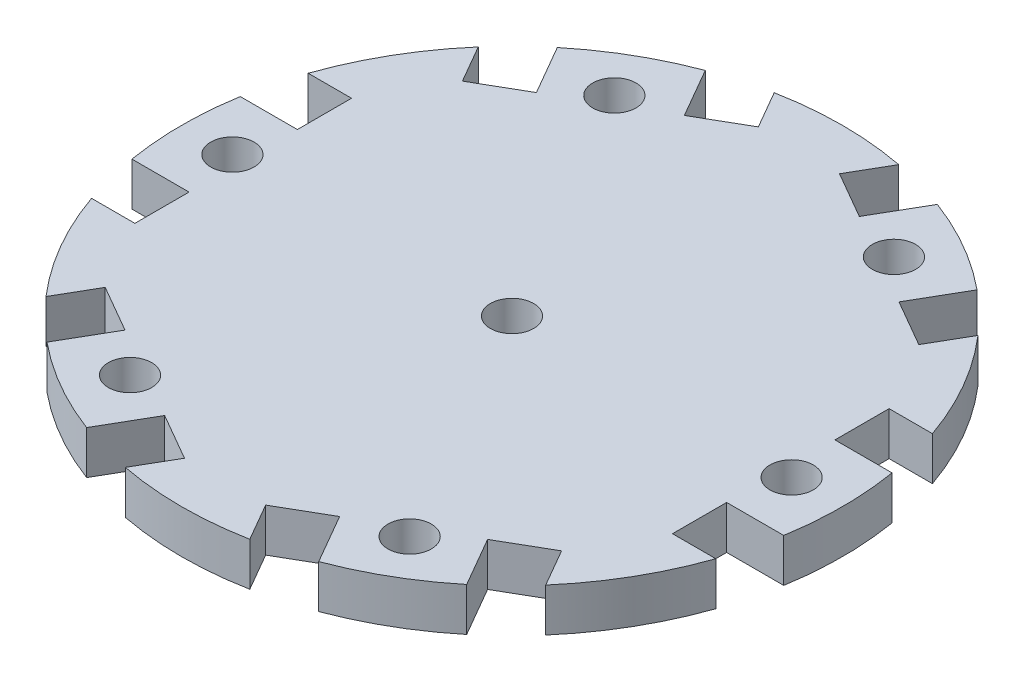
ISO-10303-21;
HEADER;
FILE_DESCRIPTION(('STEP AP214'),'2;1');
FILE_NAME('part.step','',(''),(''),'','','');
FILE_SCHEMA(('AUTOMOTIVE_DESIGN { 1 0 10303 214 1 1 1 1 }'));
ENDSEC;
DATA;
#1=APPLICATION_CONTEXT('core data for automotive mechanical design processes');
#2=APPLICATION_PROTOCOL_DEFINITION('international standard','automotive_design',2000,#1);
#3=PRODUCT_CONTEXT('',#1,'mechanical');
#4=PRODUCT('Part','Part','',(#3));
#5=PRODUCT_RELATED_PRODUCT_CATEGORY('part','',(#4));
#6=PRODUCT_DEFINITION_FORMATION('','',#4);
#7=PRODUCT_DEFINITION_CONTEXT('part definition',#1,'design');
#8=PRODUCT_DEFINITION('design','',#6,#7);
#9=PRODUCT_DEFINITION_SHAPE('','',#8);
#10=(LENGTH_UNIT() NAMED_UNIT(*) SI_UNIT(.MILLI.,.METRE.));
#11=(NAMED_UNIT(*) PLANE_ANGLE_UNIT() SI_UNIT($,.RADIAN.));
#12=(NAMED_UNIT(*) SI_UNIT($,.STERADIAN.) SOLID_ANGLE_UNIT());
#13=UNCERTAINTY_MEASURE_WITH_UNIT(LENGTH_MEASURE(1.E-05),#10,'distance_accuracy_value','');
#14=(GEOMETRIC_REPRESENTATION_CONTEXT(3) GLOBAL_UNCERTAINTY_ASSIGNED_CONTEXT((#13)) GLOBAL_UNIT_ASSIGNED_CONTEXT((#10,
#11,#12)) REPRESENTATION_CONTEXT('',''));
#15=CARTESIAN_POINT('',(0.,0.,0.));
#16=DIRECTION('',(0.,0.,1.));
#17=DIRECTION('',(1.,0.,0.));
#18=AXIS2_PLACEMENT_3D('',#15,#16,#17);
#19=CARTESIAN_POINT('',(0.,4.,0.));
#20=DIRECTION('',(0.,1.,0.));
#21=DIRECTION('',(0.,0.,1.));
#22=AXIS2_PLACEMENT_3D('',#19,#20,#21);
#23=PLANE('',#22);
#24=CARTESIAN_POINT('',(12.907029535,4.,22.3556309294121));
#25=DIRECTION('',(0.,1.,0.));
#26=DIRECTION('',(0.,0.,1.));
#27=AXIS2_PLACEMENT_3D('',#24,#25,#26);
#28=CIRCLE('',#27,2.00000000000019);
#29=CARTESIAN_POINT('',(12.907029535,4.,24.3556309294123));
#30=VERTEX_POINT('',#29);
#31=EDGE_CURVE('E705',#30,#30,#28,.T.);
#32=ORIENTED_EDGE('',*,*,#31,.F.);
#33=EDGE_LOOP('',(#32));
#34=FACE_BOUND('',#33,.T.);
#35=CARTESIAN_POINT('',(-12.907029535,4.,-22.3556309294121));
#36=DIRECTION('',(0.,1.,0.));
#37=DIRECTION('',(0.,0.,1.));
#38=AXIS2_PLACEMENT_3D('',#35,#36,#37);
#39=CIRCLE('',#38,1.99999999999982);
#40=CARTESIAN_POINT('',(-12.907029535,4.,-20.3556309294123));
#41=VERTEX_POINT('',#40);
#42=EDGE_CURVE('E685',#41,#41,#39,.F.);
#43=ORIENTED_EDGE('',*,*,#42,.T.);
#44=EDGE_LOOP('',(#43));
#45=FACE_BOUND('',#44,.T.);
#46=DIRECTION('',(0.866025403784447,0.,0.499999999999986));
#47=VECTOR('',#46,1.);
#48=CARTESIAN_POINT('',(12.4070295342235,4.,-21.4896055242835));
#49=LINE('',#48,#47);
#50=CARTESIAN_POINT('',(16.7371565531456,4.,-18.9896055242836));
#51=VERTEX_POINT('',#50);
#52=CARTESIAN_POINT('',(21.0672835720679,4.,-16.4896055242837));
#53=VERTEX_POINT('',#52);
#54=EDGE_CURVE('E358',#51,#53,#49,.T.);
#55=ORIENTED_EDGE('',*,*,#54,.F.);
#56=DIRECTION('',(0.499999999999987,0.,-0.866025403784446));
#57=VECTOR('',#56,1.);
#58=CARTESIAN_POINT('',(4.33012701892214,4.,2.49999999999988));
#59=LINE('',#58,#57);
#60=CARTESIAN_POINT('',(19.3738134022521,4.,-23.5564291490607));
#61=VERTEX_POINT('',#60);
#62=EDGE_CURVE('E372',#51,#61,#59,.T.);
#63=ORIENTED_EDGE('',*,*,#62,.T.);
#64=CARTESIAN_POINT('',(0.,4.,0.));
#65=DIRECTION('',(0.,1.,0.));
#66=DIRECTION('',(0.,0.,1.));
#67=AXIS2_PLACEMENT_3D('',#64,#65,#66);
#68=CIRCLE('',#67,30.5);
#69=CARTESIAN_POINT('',(10.7135593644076,4.,-28.5564291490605));
#70=VERTEX_POINT('',#69);
#71=EDGE_CURVE('E52',#61,#70,#68,.T.);
#72=ORIENTED_EDGE('',*,*,#71,.T.);
#73=DIRECTION('',(0.499999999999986,0.,-0.866025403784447));
#74=VECTOR('',#73,1.);
#75=CARTESIAN_POINT('',(-4.33012701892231,4.,-2.49999999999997));
#76=LINE('',#75,#74);
#77=CARTESIAN_POINT('',(8.07690251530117,4.,-23.9896055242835));
#78=VERTEX_POINT('',#77);
#79=EDGE_CURVE('E392',#78,#70,#76,.T.);
#80=ORIENTED_EDGE('',*,*,#79,.F.);
#81=DIRECTION('',(-0.866025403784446,0.,-0.499999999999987));
#82=VECTOR('',#81,1.);
#83=CARTESIAN_POINT('',(12.4070295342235,4.,-21.4896055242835));
#84=LINE('',#83,#82);
#85=CARTESIAN_POINT('',(3.74677549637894,4.,-26.4896055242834));
#86=VERTEX_POINT('',#85);
#87=EDGE_CURVE('E400',#78,#86,#84,.T.);
#88=ORIENTED_EDGE('',*,*,#87,.T.);
#89=DIRECTION('',(0.499999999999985,0.,-0.866025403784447));
#90=VECTOR('',#89,1.);
#91=CARTESIAN_POINT('',(-8.66025403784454,4.,-4.99999999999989));
#92=LINE('',#91,#90);
#93=CARTESIAN_POINT('',(5.74677549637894,4.,-29.9537071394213));
#94=VERTEX_POINT('',#93);
#95=EDGE_CURVE('E385',#86,#94,#92,.T.);
#96=ORIENTED_EDGE('',*,*,#95,.T.);
#97=CARTESIAN_POINT('',(-5.74677549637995,4.,-29.9537071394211));
#98=VERTEX_POINT('',#97);
#99=EDGE_CURVE('E1313',#94,#98,#68,.T.);
#100=ORIENTED_EDGE('',*,*,#99,.T.);
#101=DIRECTION('',(-0.500000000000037,0.,-0.866025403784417));
#102=VECTOR('',#101,1.);
#103=CARTESIAN_POINT('',(8.66025403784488,4.,-5.00000000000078));
#104=LINE('',#103,#102);
#105=CARTESIAN_POINT('',(-3.74677549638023,4.,-26.4896055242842));
#106=VERTEX_POINT('',#105);
#107=EDGE_CURVE('E416',#106,#98,#104,.T.);
#108=ORIENTED_EDGE('',*,*,#107,.F.);
#109=DIRECTION('',(0.866025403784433,0.,-0.50000000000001));
#110=VECTOR('',#109,1.);
#111=CARTESIAN_POINT('',(-12.4070295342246,4.,-21.489605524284));
#112=LINE('',#111,#110);
#113=CARTESIAN_POINT('',(-8.07690251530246,4.,-23.9896055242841));
#114=VERTEX_POINT('',#113);
#115=EDGE_CURVE('E425',#114,#106,#112,.T.);
#116=ORIENTED_EDGE('',*,*,#115,.F.);
#117=DIRECTION('',(-0.50000000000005,0.,-0.86602540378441));
#118=VECTOR('',#117,1.);
#119=CARTESIAN_POINT('',(4.33012701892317,4.,-2.50000000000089));
#120=LINE('',#119,#118);
#121=CARTESIAN_POINT('',(-10.7135593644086,4.,-28.5564291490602));
#122=VERTEX_POINT('',#121);
#123=EDGE_CURVE('E406',#114,#122,#120,.T.);
#124=ORIENTED_EDGE('',*,*,#123,.T.);
#125=CARTESIAN_POINT('',(-19.3738134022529,4.,-23.55642914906));
#126=VERTEX_POINT('',#125);
#127=EDGE_CURVE('E1365',#122,#126,#68,.T.);
#128=ORIENTED_EDGE('',*,*,#127,.T.);
#129=DIRECTION('',(-0.500000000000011,0.,-0.866025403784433));
#130=VECTOR('',#129,1.);
#131=CARTESIAN_POINT('',(-4.3301270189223,4.,2.50000000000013));
#132=LINE('',#131,#130);
#133=CARTESIAN_POINT('',(-16.737156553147,4.,-18.9896055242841));
#134=VERTEX_POINT('',#133);
#135=EDGE_CURVE('E432',#134,#126,#132,.T.);
#136=ORIENTED_EDGE('',*,*,#135,.F.);
#137=DIRECTION('',(-0.866025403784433,0.,0.50000000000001));
#138=VECTOR('',#137,1.);
#139=CARTESIAN_POINT('',(-12.4070295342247,4.,-21.4896055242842));
#140=LINE('',#139,#138);
#141=CARTESIAN_POINT('',(-21.0672835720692,4.,-16.489605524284));
#142=VERTEX_POINT('',#141);
#143=EDGE_CURVE('E443',#134,#142,#140,.T.);
#144=ORIENTED_EDGE('',*,*,#143,.T.);
#145=DIRECTION('',(-0.499999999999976,0.,-0.866025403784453));
#146=VECTOR('',#145,1.);
#147=CARTESIAN_POINT('',(-8.6602540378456,4.,5.00000000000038));
#148=LINE('',#147,#146);
#149=CARTESIAN_POINT('',(-23.0672835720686,4.,-19.9537071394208));
#150=VERTEX_POINT('',#149);
#151=EDGE_CURVE('E450',#142,#150,#148,.T.);
#152=ORIENTED_EDGE('',*,*,#151,.T.);
#153=CARTESIAN_POINT('',(-28.8140590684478,4.,-10.));
#154=VERTEX_POINT('',#153);
#155=EDGE_CURVE('E676',#150,#154,#68,.T.);
#156=ORIENTED_EDGE('',*,*,#155,.T.);
#157=DIRECTION('',(-1.,0.,0.));
#158=VECTOR('',#157,1.);
#159=CARTESIAN_POINT('',(0.,4.,-10.));
#160=LINE('',#159,#158);
#161=CARTESIAN_POINT('',(-24.8140590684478,4.,-10.));
#162=VERTEX_POINT('',#161);
#163=EDGE_CURVE('E644',#162,#154,#160,.T.);
#164=ORIENTED_EDGE('',*,*,#163,.F.);
#165=DIRECTION('',(0.,0.,-1.));
#166=VECTOR('',#165,1.);
#167=CARTESIAN_POINT('',(-24.8140590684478,4.,0.));
#168=LINE('',#167,#166);
#169=CARTESIAN_POINT('',(-24.8140590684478,4.,-5.));
#170=VERTEX_POINT('',#169);
#171=EDGE_CURVE('E653',#170,#162,#168,.T.);
#172=ORIENTED_EDGE('',*,*,#171,.F.);
#173=DIRECTION('',(-1.,0.,0.));
#174=VECTOR('',#173,1.);
#175=CARTESIAN_POINT('',(0.,4.,-5.));
#176=LINE('',#175,#174);
#177=CARTESIAN_POINT('',(-30.0873727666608,4.,-5.));
#178=VERTEX_POINT('',#177);
#179=EDGE_CURVE('E634',#170,#178,#176,.T.);
#180=ORIENTED_EDGE('',*,*,#179,.T.);
#181=CARTESIAN_POINT('',(-30.0873727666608,4.,5.));
#182=VERTEX_POINT('',#181);
#183=EDGE_CURVE('E12',#178,#182,#68,.T.);
#184=ORIENTED_EDGE('',*,*,#183,.T.);
#185=DIRECTION('',(-1.,0.,0.));
#186=VECTOR('',#185,1.);
#187=CARTESIAN_POINT('',(0.,4.,5.00000000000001));
#188=LINE('',#187,#186);
#189=CARTESIAN_POINT('',(-24.8140590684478,4.,5.));
#190=VERTEX_POINT('',#189);
#191=EDGE_CURVE('E457',#190,#182,#188,.T.);
#192=ORIENTED_EDGE('',*,*,#191,.F.);
#193=DIRECTION('',(0.,0.,1.));
#194=VECTOR('',#193,1.);
#195=CARTESIAN_POINT('',(-24.8140590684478,4.,0.));
#196=LINE('',#195,#194);
#197=CARTESIAN_POINT('',(-24.8140590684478,4.,10.));
#198=VERTEX_POINT('',#197);
#199=EDGE_CURVE('E468',#190,#198,#196,.T.);
#200=ORIENTED_EDGE('',*,*,#199,.T.);
#201=DIRECTION('',(-1.,0.,0.));
#202=VECTOR('',#201,1.);
#203=CARTESIAN_POINT('',(0.,4.,10.));
#204=LINE('',#203,#202);
#205=CARTESIAN_POINT('',(-28.8140590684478,4.,10.));
#206=VERTEX_POINT('',#205);
#207=EDGE_CURVE('E474',#198,#206,#204,.T.);
#208=ORIENTED_EDGE('',*,*,#207,.T.);
#209=CARTESIAN_POINT('',(-23.067283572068,4.,19.9537071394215));
#210=VERTEX_POINT('',#209);
#211=EDGE_CURVE('E50',#206,#210,#68,.T.);
#212=ORIENTED_EDGE('',*,*,#211,.T.);
#213=DIRECTION('',(-0.499999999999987,0.,0.866025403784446));
#214=VECTOR('',#213,1.);
#215=CARTESIAN_POINT('',(-8.6602540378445,4.,-4.9999999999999));
#216=LINE('',#215,#214);
#217=CARTESIAN_POINT('',(-21.0672835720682,4.,16.4896055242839));
#218=VERTEX_POINT('',#217);
#219=EDGE_CURVE('E491',#218,#210,#216,.T.);
#220=ORIENTED_EDGE('',*,*,#219,.F.);
#221=DIRECTION('',(-0.866025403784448,0.,-0.499999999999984));
#222=VECTOR('',#221,1.);
#223=CARTESIAN_POINT('',(-12.4070295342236,4.,21.4896055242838));
#224=LINE('',#223,#222);
#225=CARTESIAN_POINT('',(-16.7371565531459,4.,18.9896055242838));
#226=VERTEX_POINT('',#225);
#227=EDGE_CURVE('E500',#226,#218,#224,.T.);
#228=ORIENTED_EDGE('',*,*,#227,.F.);
#229=DIRECTION('',(-0.499999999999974,0.,0.866025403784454));
#230=VECTOR('',#229,1.);
#231=CARTESIAN_POINT('',(-4.3301270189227,4.,-2.50000000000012));
#232=LINE('',#231,#230);
#233=CARTESIAN_POINT('',(-19.3738134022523,4.,23.5564291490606));
#234=VERTEX_POINT('',#233);
#235=EDGE_CURVE('E481',#226,#234,#232,.T.);
#236=ORIENTED_EDGE('',*,*,#235,.T.);
#237=CARTESIAN_POINT('',(-10.7135593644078,4.,28.5564291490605));
#238=VERTEX_POINT('',#237);
#239=EDGE_CURVE('E1371',#234,#238,#68,.T.);
#240=ORIENTED_EDGE('',*,*,#239,.T.);
#241=DIRECTION('',(-0.5,0.,0.866025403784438));
#242=VECTOR('',#241,1.);
#243=CARTESIAN_POINT('',(4.3301270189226,4.,2.50000000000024));
#244=LINE('',#243,#242);
#245=CARTESIAN_POINT('',(-8.07690251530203,4.,23.9896055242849));
#246=VERTEX_POINT('',#245);
#247=EDGE_CURVE('E507',#246,#238,#244,.T.);
#248=ORIENTED_EDGE('',*,*,#247,.F.);
#249=DIRECTION('',(0.866025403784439,0.,0.5));
#250=VECTOR('',#249,1.);
#251=CARTESIAN_POINT('',(-12.4070295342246,4.,21.4896055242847));
#252=LINE('',#251,#250);
#253=CARTESIAN_POINT('',(-3.74677549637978,4.,26.4896055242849));
#254=VERTEX_POINT('',#253);
#255=EDGE_CURVE('E518',#246,#254,#252,.T.);
#256=ORIENTED_EDGE('',*,*,#255,.T.);
#257=DIRECTION('',(-0.500000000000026,0.,0.866025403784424));
#258=VECTOR('',#257,1.);
#259=CARTESIAN_POINT('',(8.66025403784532,4.,5.00000000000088));
#260=LINE('',#259,#258);
#261=CARTESIAN_POINT('',(-5.74677549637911,4.,29.9537071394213));
#262=VERTEX_POINT('',#261);
#263=EDGE_CURVE('E525',#254,#262,#260,.T.);
#264=ORIENTED_EDGE('',*,*,#263,.T.);
#265=CARTESIAN_POINT('',(5.74677549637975,4.,29.9537071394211));
#266=VERTEX_POINT('',#265);
#267=EDGE_CURVE('E1374',#262,#266,#68,.T.);
#268=ORIENTED_EDGE('',*,*,#267,.T.);
#269=DIRECTION('',(0.500000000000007,0.,0.866025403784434));
#270=VECTOR('',#269,1.);
#271=CARTESIAN_POINT('',(-8.66025403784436,4.,5.00000000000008));
#272=LINE('',#271,#270);
#273=CARTESIAN_POINT('',(3.74677549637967,4.,26.4896055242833));
#274=VERTEX_POINT('',#273);
#275=EDGE_CURVE('E551',#274,#266,#272,.T.);
#276=ORIENTED_EDGE('',*,*,#275,.F.);
#277=DIRECTION('',(-0.866025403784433,0.,0.50000000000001));
#278=VECTOR('',#277,1.);
#279=CARTESIAN_POINT('',(12.4070295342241,4.,21.4896055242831));
#280=LINE('',#279,#278);
#281=CARTESIAN_POINT('',(8.07690251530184,4.,23.9896055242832));
#282=VERTEX_POINT('',#281);
#283=EDGE_CURVE('E532',#282,#274,#280,.T.);
#284=ORIENTED_EDGE('',*,*,#283,.F.);
#285=DIRECTION('',(0.500000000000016,0.,0.866025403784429));
#286=VECTOR('',#285,1.);
#287=CARTESIAN_POINT('',(-4.33012701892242,4.,2.50000000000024));
#288=LINE('',#287,#286);
#289=CARTESIAN_POINT('',(10.7135593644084,4.,28.5564291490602));
#290=VERTEX_POINT('',#289);
#291=EDGE_CURVE('E543',#282,#290,#288,.T.);
#292=ORIENTED_EDGE('',*,*,#291,.T.);
#293=CARTESIAN_POINT('',(19.3738134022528,4.,23.5564291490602));
#294=VERTEX_POINT('',#293);
#295=EDGE_CURVE('E1364',#290,#294,#68,.T.);
#296=ORIENTED_EDGE('',*,*,#295,.T.);
#297=DIRECTION('',(0.50000000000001,0.,0.866025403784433));
#298=VECTOR('',#297,1.);
#299=CARTESIAN_POINT('',(4.33012701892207,4.,-2.5));
#300=LINE('',#299,#298);
#301=CARTESIAN_POINT('',(16.7371565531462,4.,18.9896055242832));
#302=VERTEX_POINT('',#301);
#303=EDGE_CURVE('E568',#302,#294,#300,.T.);
#304=ORIENTED_EDGE('',*,*,#303,.F.);
#305=DIRECTION('',(0.866025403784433,0.,-0.500000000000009));
#306=VECTOR('',#305,1.);
#307=CARTESIAN_POINT('',(12.4070295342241,4.,21.4896055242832));
#308=LINE('',#307,#306);
#309=CARTESIAN_POINT('',(21.0672835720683,4.,16.4896055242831));
#310=VERTEX_POINT('',#309);
#311=EDGE_CURVE('E576',#302,#310,#308,.T.);
#312=ORIENTED_EDGE('',*,*,#311,.T.);
#313=DIRECTION('',(0.50000000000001,0.,0.866025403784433));
#314=VECTOR('',#313,1.);
#315=CARTESIAN_POINT('',(8.66025403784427,4.,-5.00000000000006));
#316=LINE('',#315,#314);
#317=CARTESIAN_POINT('',(23.0672835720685,4.,19.953707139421));
#318=VERTEX_POINT('',#317);
#319=EDGE_CURVE('E558',#310,#318,#316,.T.);
#320=ORIENTED_EDGE('',*,*,#319,.T.);
#321=CARTESIAN_POINT('',(28.8140590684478,4.,10.));
#322=VERTEX_POINT('',#321);
#323=EDGE_CURVE('E1363',#318,#322,#68,.T.);
#324=ORIENTED_EDGE('',*,*,#323,.T.);
#325=DIRECTION('',(1.,0.,0.));
#326=VECTOR('',#325,1.);
#327=CARTESIAN_POINT('',(3.98986399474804E-13,4.,10.0000000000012));
#328=LINE('',#327,#326);
#329=CARTESIAN_POINT('',(24.8140590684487,4.,10.0000000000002));
#330=VERTEX_POINT('',#329);
#331=EDGE_CURVE('E602',#330,#322,#328,.T.);
#332=ORIENTED_EDGE('',*,*,#331,.F.);
#333=DIRECTION('',(0.,0.,1.));
#334=VECTOR('',#333,1.);
#335=CARTESIAN_POINT('',(24.8140590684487,4.,0.));
#336=LINE('',#335,#334);
#337=CARTESIAN_POINT('',(24.8140590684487,4.,5.00000000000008));
#338=VERTEX_POINT('',#337);
#339=EDGE_CURVE('E583',#338,#330,#336,.T.);
#340=ORIENTED_EDGE('',*,*,#339,.F.);
#341=DIRECTION('',(1.,0.,0.));
#342=VECTOR('',#341,1.);
#343=CARTESIAN_POINT('',(3.16750859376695E-13,4.,5.00000000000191));
#344=LINE('',#343,#342);
#345=CARTESIAN_POINT('',(30.0873727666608,4.,5.));
#346=VERTEX_POINT('',#345);
#347=EDGE_CURVE('E594',#338,#346,#344,.T.);
#348=ORIENTED_EDGE('',*,*,#347,.T.);
#349=CARTESIAN_POINT('',(30.0873727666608,4.,-5.));
#350=VERTEX_POINT('',#349);
#351=EDGE_CURVE('E1362',#346,#350,#68,.T.);
#352=ORIENTED_EDGE('',*,*,#351,.T.);
#353=DIRECTION('',(1.,0.,0.));
#354=VECTOR('',#353,1.);
#355=CARTESIAN_POINT('',(0.,4.,-5.00000000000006));
#356=LINE('',#355,#354);
#357=CARTESIAN_POINT('',(24.8140590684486,4.,-5.00000000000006));
#358=VERTEX_POINT('',#357);
#359=EDGE_CURVE('E619',#358,#350,#356,.T.);
#360=ORIENTED_EDGE('',*,*,#359,.F.);
#361=DIRECTION('',(0.,0.,-1.));
#362=VECTOR('',#361,1.);
#363=CARTESIAN_POINT('',(24.8140590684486,4.,0.));
#364=LINE('',#363,#362);
#365=CARTESIAN_POINT('',(24.8140590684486,4.,-10.0000000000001));
#366=VERTEX_POINT('',#365);
#367=EDGE_CURVE('E627',#358,#366,#364,.T.);
#368=ORIENTED_EDGE('',*,*,#367,.T.);
#369=DIRECTION('',(1.,0.,0.));
#370=VECTOR('',#369,1.);
#371=CARTESIAN_POINT('',(3.12250225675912E-13,4.,-10.0000000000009));
#372=LINE('',#371,#370);
#373=CARTESIAN_POINT('',(28.8140590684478,4.,-10.));
#374=VERTEX_POINT('',#373);
#375=EDGE_CURVE('E609',#366,#374,#372,.T.);
#376=ORIENTED_EDGE('',*,*,#375,.T.);
#377=CARTESIAN_POINT('',(23.0672835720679,4.,-19.9537071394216));
#378=VERTEX_POINT('',#377);
#379=EDGE_CURVE('E53',#374,#378,#68,.T.);
#380=ORIENTED_EDGE('',*,*,#379,.T.);
#381=DIRECTION('',(0.499999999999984,0.,-0.866025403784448));
#382=VECTOR('',#381,1.);
#383=CARTESIAN_POINT('',(8.66025403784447,4.,4.99999999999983));
#384=LINE('',#383,#382);
#385=EDGE_CURVE('E60',#53,#378,#384,.T.);
#386=ORIENTED_EDGE('',*,*,#385,.F.);
#387=EDGE_LOOP('',(#55,#63,#72,#80,#88,#96,#100,#108,#116,#124,#128,#136,#144,#152,#156,#164,
#172,#180,#184,#192,#200,#208,#212,#220,#228,#236,#240,#248,#256,#264,#268,#276,#284,#292,#296,
#304,#312,#320,#324,#332,#340,#348,#352,#360,#368,#376,#380,#386));
#388=FACE_BOUND('',#387,.T.);
#389=CARTESIAN_POINT('',(0.,4.,0.));
#390=DIRECTION('',(0.,1.,0.));
#391=DIRECTION('',(0.,0.,1.));
#392=AXIS2_PLACEMENT_3D('',#389,#390,#391);
#393=CIRCLE('',#392,2.);
#394=CARTESIAN_POINT('',(0.,4.,2.));
#395=VERTEX_POINT('',#394);
#396=EDGE_CURVE('E660',#395,#395,#393,.T.);
#397=ORIENTED_EDGE('',*,*,#396,.F.);
#398=EDGE_LOOP('',(#397));
#399=FACE_BOUND('',#398,.T.);
#400=CARTESIAN_POINT('',(-25.81405907,4.,0.));
#401=DIRECTION('',(0.,1.,0.));
#402=DIRECTION('',(0.,0.,1.));
#403=AXIS2_PLACEMENT_3D('',#400,#401,#402);
#404=CIRCLE('',#403,2.);
#405=CARTESIAN_POINT('',(-25.81405907,4.,2.));
#406=VERTEX_POINT('',#405);
#407=EDGE_CURVE('E376',#406,#406,#404,.F.);
#408=ORIENTED_EDGE('',*,*,#407,.T.);
#409=EDGE_LOOP('',(#408));
#410=FACE_BOUND('',#409,.T.);
#411=CARTESIAN_POINT('',(12.907029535,4.,-22.3556309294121));
#412=DIRECTION('',(0.,1.,0.));
#413=DIRECTION('',(0.,0.,1.));
#414=AXIS2_PLACEMENT_3D('',#411,#412,#413);
#415=CIRCLE('',#414,2.00000000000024);
#416=CARTESIAN_POINT('',(12.907029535,4.,-20.3556309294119));
#417=VERTEX_POINT('',#416);
#418=EDGE_CURVE('E689',#417,#417,#415,.T.);
#419=ORIENTED_EDGE('',*,*,#418,.F.);
#420=EDGE_LOOP('',(#419));
#421=FACE_BOUND('',#420,.T.);
#422=CARTESIAN_POINT('',(25.81405907,4.,0.));
#423=DIRECTION('',(0.,1.,0.));
#424=DIRECTION('',(0.,0.,1.));
#425=AXIS2_PLACEMENT_3D('',#422,#423,#424);
#426=CIRCLE('',#425,2.);
#427=CARTESIAN_POINT('',(25.81405907,4.,1.99999999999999));
#428=VERTEX_POINT('',#427);
#429=EDGE_CURVE('E692',#428,#428,#426,.T.);
#430=ORIENTED_EDGE('',*,*,#429,.F.);
#431=EDGE_LOOP('',(#430));
#432=FACE_BOUND('',#431,.T.);
#433=CARTESIAN_POINT('',(-12.907029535,4.,22.3556309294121));
#434=DIRECTION('',(0.,1.,0.));
#435=DIRECTION('',(0.,0.,1.));
#436=AXIS2_PLACEMENT_3D('',#433,#434,#435);
#437=CIRCLE('',#436,1.99999999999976);
#438=CARTESIAN_POINT('',(-12.907029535,4.,24.3556309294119));
#439=VERTEX_POINT('',#438);
#440=EDGE_CURVE('E695',#439,#439,#437,.F.);
#441=ORIENTED_EDGE('',*,*,#440,.T.);
#442=EDGE_LOOP('',(#441));
#443=FACE_BOUND('',#442,.T.);
#444=ADVANCED_FACE('F41',(#34,#45,#388,#399,#410,#421,#432,#443),#23,.T.);
#445=CARTESIAN_POINT('',(0.,0.,0.));
#446=DIRECTION('',(0.,1.,0.));
#447=DIRECTION('',(0.,0.,1.));
#448=AXIS2_PLACEMENT_3D('',#445,#446,#447);
#449=PLANE('',#448);
#450=CARTESIAN_POINT('',(12.907029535,0.,22.3556309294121));
#451=DIRECTION('',(0.,1.,0.));
#452=DIRECTION('',(0.,0.,1.));
#453=AXIS2_PLACEMENT_3D('',#450,#451,#452);
#454=CIRCLE('',#453,2.00000000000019);
#455=CARTESIAN_POINT('',(12.907029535,0.,24.3556309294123));
#456=VERTEX_POINT('',#455);
#457=EDGE_CURVE('E45',#456,#456,#454,.T.);
#458=ORIENTED_EDGE('',*,*,#457,.T.);
#459=EDGE_LOOP('',(#458));
#460=FACE_BOUND('',#459,.T.);
#461=CARTESIAN_POINT('',(-12.907029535,0.,-22.3556309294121));
#462=DIRECTION('',(0.,1.,0.));
#463=DIRECTION('',(0.,0.,1.));
#464=AXIS2_PLACEMENT_3D('',#461,#462,#463);
#465=CIRCLE('',#464,1.99999999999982);
#466=CARTESIAN_POINT('',(-12.907029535,0.,-20.3556309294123));
#467=VERTEX_POINT('',#466);
#468=EDGE_CURVE('E682',#467,#467,#465,.F.);
#469=ORIENTED_EDGE('',*,*,#468,.F.);
#470=EDGE_LOOP('',(#469));
#471=FACE_BOUND('',#470,.T.);
#472=DIRECTION('',(0.499999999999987,0.,-0.866025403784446));
#473=VECTOR('',#472,1.);
#474=CARTESIAN_POINT('',(4.33012701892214,0.,2.49999999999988));
#475=LINE('',#474,#473);
#476=CARTESIAN_POINT('',(16.7371565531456,0.,-18.9896055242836));
#477=VERTEX_POINT('',#476);
#478=CARTESIAN_POINT('',(19.3738134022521,0.,-23.5564291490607));
#479=VERTEX_POINT('',#478);
#480=EDGE_CURVE('E360',#477,#479,#475,.T.);
#481=ORIENTED_EDGE('',*,*,#480,.F.);
#482=DIRECTION('',(0.866025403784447,0.,0.499999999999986));
#483=VECTOR('',#482,1.);
#484=CARTESIAN_POINT('',(12.4070295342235,0.,-21.4896055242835));
#485=LINE('',#484,#483);
#486=CARTESIAN_POINT('',(21.0672835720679,0.,-16.4896055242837));
#487=VERTEX_POINT('',#486);
#488=EDGE_CURVE('E355',#477,#487,#485,.T.);
#489=ORIENTED_EDGE('',*,*,#488,.T.);
#490=DIRECTION('',(0.499999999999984,0.,-0.866025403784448));
#491=VECTOR('',#490,1.);
#492=CARTESIAN_POINT('',(8.66025403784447,0.,4.99999999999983));
#493=LINE('',#492,#491);
#494=CARTESIAN_POINT('',(23.0672835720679,0.,-19.9537071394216));
#495=VERTEX_POINT('',#494);
#496=EDGE_CURVE('E363',#487,#495,#493,.T.);
#497=ORIENTED_EDGE('',*,*,#496,.T.);
#498=CARTESIAN_POINT('',(0.,0.,0.));
#499=DIRECTION('',(0.,1.,0.));
#500=DIRECTION('',(0.,0.,1.));
#501=AXIS2_PLACEMENT_3D('',#498,#499,#500);
#502=CIRCLE('',#501,30.5);
#503=CARTESIAN_POINT('',(28.8140590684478,0.,-10.));
#504=VERTEX_POINT('',#503);
#505=EDGE_CURVE('E679',#504,#495,#502,.T.);
#506=ORIENTED_EDGE('',*,*,#505,.F.);
#507=DIRECTION('',(1.,0.,0.));
#508=VECTOR('',#507,1.);
#509=CARTESIAN_POINT('',(3.12250225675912E-13,0.,-10.0000000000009));
#510=LINE('',#509,#508);
#511=CARTESIAN_POINT('',(24.8140590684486,0.,-10.0000000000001));
#512=VERTEX_POINT('',#511);
#513=EDGE_CURVE('E616',#512,#504,#510,.T.);
#514=ORIENTED_EDGE('',*,*,#513,.F.);
#515=DIRECTION('',(0.,0.,-1.));
#516=VECTOR('',#515,1.);
#517=CARTESIAN_POINT('',(24.8140590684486,0.,0.));
#518=LINE('',#517,#516);
#519=CARTESIAN_POINT('',(24.8140590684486,0.,-5.00000000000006));
#520=VERTEX_POINT('',#519);
#521=EDGE_CURVE('E618',#520,#512,#518,.T.);
#522=ORIENTED_EDGE('',*,*,#521,.F.);
#523=DIRECTION('',(1.,0.,0.));
#524=VECTOR('',#523,1.);
#525=CARTESIAN_POINT('',(0.,0.,-5.00000000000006));
#526=LINE('',#525,#524);
#527=CARTESIAN_POINT('',(30.0873727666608,0.,-5.));
#528=VERTEX_POINT('',#527);
#529=EDGE_CURVE('E621',#520,#528,#526,.T.);
#530=ORIENTED_EDGE('',*,*,#529,.T.);
#531=CARTESIAN_POINT('',(30.0873727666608,0.,5.));
#532=VERTEX_POINT('',#531);
#533=EDGE_CURVE('E1341',#532,#528,#502,.T.);
#534=ORIENTED_EDGE('',*,*,#533,.F.);
#535=DIRECTION('',(1.,0.,0.));
#536=VECTOR('',#535,1.);
#537=CARTESIAN_POINT('',(3.16750859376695E-13,0.,5.00000000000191));
#538=LINE('',#537,#536);
#539=CARTESIAN_POINT('',(24.8140590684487,0.,5.00000000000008));
#540=VERTEX_POINT('',#539);
#541=EDGE_CURVE('E597',#540,#532,#538,.T.);
#542=ORIENTED_EDGE('',*,*,#541,.F.);
#543=DIRECTION('',(0.,0.,1.));
#544=VECTOR('',#543,1.);
#545=CARTESIAN_POINT('',(24.8140590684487,0.,0.));
#546=LINE('',#545,#544);
#547=CARTESIAN_POINT('',(24.8140590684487,0.,10.0000000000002));
#548=VERTEX_POINT('',#547);
#549=EDGE_CURVE('E590',#540,#548,#546,.T.);
#550=ORIENTED_EDGE('',*,*,#549,.T.);
#551=DIRECTION('',(1.,0.,0.));
#552=VECTOR('',#551,1.);
#553=CARTESIAN_POINT('',(3.98986399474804E-13,0.,10.0000000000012));
#554=LINE('',#553,#552);
#555=CARTESIAN_POINT('',(28.8140590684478,0.,10.));
#556=VERTEX_POINT('',#555);
#557=EDGE_CURVE('E593',#548,#556,#554,.T.);
#558=ORIENTED_EDGE('',*,*,#557,.T.);
#559=CARTESIAN_POINT('',(23.0672835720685,0.,19.953707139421));
#560=VERTEX_POINT('',#559);
#561=EDGE_CURVE('E1337',#560,#556,#502,.T.);
#562=ORIENTED_EDGE('',*,*,#561,.F.);
#563=DIRECTION('',(0.50000000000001,0.,0.866025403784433));
#564=VECTOR('',#563,1.);
#565=CARTESIAN_POINT('',(8.66025403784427,0.,-5.00000000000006));
#566=LINE('',#565,#564);
#567=CARTESIAN_POINT('',(21.0672835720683,0.,16.4896055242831));
#568=VERTEX_POINT('',#567);
#569=EDGE_CURVE('E565',#568,#560,#566,.T.);
#570=ORIENTED_EDGE('',*,*,#569,.F.);
#571=DIRECTION('',(0.866025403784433,0.,-0.500000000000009));
#572=VECTOR('',#571,1.);
#573=CARTESIAN_POINT('',(12.4070295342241,0.,21.4896055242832));
#574=LINE('',#573,#572);
#575=CARTESIAN_POINT('',(16.7371565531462,0.,18.9896055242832));
#576=VERTEX_POINT('',#575);
#577=EDGE_CURVE('E567',#576,#568,#574,.T.);
#578=ORIENTED_EDGE('',*,*,#577,.F.);
#579=DIRECTION('',(0.50000000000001,0.,0.866025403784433));
#580=VECTOR('',#579,1.);
#581=CARTESIAN_POINT('',(4.33012701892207,0.,-2.5));
#582=LINE('',#581,#580);
#583=CARTESIAN_POINT('',(19.3738134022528,0.,23.5564291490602));
#584=VERTEX_POINT('',#583);
#585=EDGE_CURVE('E570',#576,#584,#582,.T.);
#586=ORIENTED_EDGE('',*,*,#585,.T.);
#587=CARTESIAN_POINT('',(10.7135593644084,0.,28.5564291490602));
#588=VERTEX_POINT('',#587);
#589=EDGE_CURVE('E1333',#588,#584,#502,.T.);
#590=ORIENTED_EDGE('',*,*,#589,.F.);
#591=DIRECTION('',(0.500000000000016,0.,0.866025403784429));
#592=VECTOR('',#591,1.);
#593=CARTESIAN_POINT('',(-4.33012701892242,0.,2.50000000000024));
#594=LINE('',#593,#592);
#595=CARTESIAN_POINT('',(8.07690251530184,0.,23.9896055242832));
#596=VERTEX_POINT('',#595);
#597=EDGE_CURVE('E546',#596,#588,#594,.T.);
#598=ORIENTED_EDGE('',*,*,#597,.F.);
#599=DIRECTION('',(-0.866025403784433,0.,0.50000000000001));
#600=VECTOR('',#599,1.);
#601=CARTESIAN_POINT('',(12.4070295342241,0.,21.4896055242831));
#602=LINE('',#601,#600);
#603=CARTESIAN_POINT('',(3.74677549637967,0.,26.4896055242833));
#604=VERTEX_POINT('',#603);
#605=EDGE_CURVE('E539',#596,#604,#602,.T.);
#606=ORIENTED_EDGE('',*,*,#605,.T.);
#607=DIRECTION('',(0.500000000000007,0.,0.866025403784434));
#608=VECTOR('',#607,1.);
#609=CARTESIAN_POINT('',(-8.66025403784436,0.,5.00000000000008));
#610=LINE('',#609,#608);
#611=CARTESIAN_POINT('',(5.74677549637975,0.,29.9537071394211));
#612=VERTEX_POINT('',#611);
#613=EDGE_CURVE('E542',#604,#612,#610,.T.);
#614=ORIENTED_EDGE('',*,*,#613,.T.);
#615=CARTESIAN_POINT('',(-5.7467754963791,0.,29.9537071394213));
#616=VERTEX_POINT('',#615);
#617=EDGE_CURVE('E1329',#616,#612,#502,.T.);
#618=ORIENTED_EDGE('',*,*,#617,.F.);
#619=DIRECTION('',(-0.500000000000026,0.,0.866025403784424));
#620=VECTOR('',#619,1.);
#621=CARTESIAN_POINT('',(8.66025403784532,0.,5.00000000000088));
#622=LINE('',#621,#620);
#623=CARTESIAN_POINT('',(-3.74677549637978,0.,26.4896055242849));
#624=VERTEX_POINT('',#623);
#625=EDGE_CURVE('E517',#624,#616,#622,.T.);
#626=ORIENTED_EDGE('',*,*,#625,.F.);
#627=DIRECTION('',(0.866025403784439,0.,0.5));
#628=VECTOR('',#627,1.);
#629=CARTESIAN_POINT('',(-12.4070295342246,0.,21.4896055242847));
#630=LINE('',#629,#628);
#631=CARTESIAN_POINT('',(-8.07690251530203,0.,23.9896055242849));
#632=VERTEX_POINT('',#631);
#633=EDGE_CURVE('E520',#632,#624,#630,.T.);
#634=ORIENTED_EDGE('',*,*,#633,.F.);
#635=DIRECTION('',(-0.5,0.,0.866025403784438));
#636=VECTOR('',#635,1.);
#637=CARTESIAN_POINT('',(4.3301270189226,0.,2.50000000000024));
#638=LINE('',#637,#636);
#639=CARTESIAN_POINT('',(-10.7135593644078,0.,28.5564291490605));
#640=VERTEX_POINT('',#639);
#641=EDGE_CURVE('E514',#632,#640,#638,.T.);
#642=ORIENTED_EDGE('',*,*,#641,.T.);
#643=CARTESIAN_POINT('',(-19.3738134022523,0.,23.5564291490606));
#644=VERTEX_POINT('',#643);
#645=EDGE_CURVE('E1325',#644,#640,#502,.T.);
#646=ORIENTED_EDGE('',*,*,#645,.F.);
#647=DIRECTION('',(-0.499999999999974,0.,0.866025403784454));
#648=VECTOR('',#647,1.);
#649=CARTESIAN_POINT('',(-4.3301270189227,0.,-2.50000000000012));
#650=LINE('',#649,#648);
#651=CARTESIAN_POINT('',(-16.7371565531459,0.,18.9896055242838));
#652=VERTEX_POINT('',#651);
#653=EDGE_CURVE('E488',#652,#644,#650,.T.);
#654=ORIENTED_EDGE('',*,*,#653,.F.);
#655=DIRECTION('',(-0.866025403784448,0.,-0.499999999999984));
#656=VECTOR('',#655,1.);
#657=CARTESIAN_POINT('',(-12.4070295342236,0.,21.4896055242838));
#658=LINE('',#657,#656);
#659=CARTESIAN_POINT('',(-21.0672835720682,0.,16.4896055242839));
#660=VERTEX_POINT('',#659);
#661=EDGE_CURVE('E490',#652,#660,#658,.T.);
#662=ORIENTED_EDGE('',*,*,#661,.T.);
#663=DIRECTION('',(-0.499999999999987,0.,0.866025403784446));
#664=VECTOR('',#663,1.);
#665=CARTESIAN_POINT('',(-8.6602540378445,0.,-4.9999999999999));
#666=LINE('',#665,#664);
#667=CARTESIAN_POINT('',(-23.067283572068,0.,19.9537071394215));
#668=VERTEX_POINT('',#667);
#669=EDGE_CURVE('E494',#660,#668,#666,.T.);
#670=ORIENTED_EDGE('',*,*,#669,.T.);
#671=CARTESIAN_POINT('',(-28.8140590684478,0.,10.));
#672=VERTEX_POINT('',#671);
#673=EDGE_CURVE('E677',#672,#668,#502,.T.);
#674=ORIENTED_EDGE('',*,*,#673,.F.);
#675=DIRECTION('',(-1.,0.,0.));
#676=VECTOR('',#675,1.);
#677=CARTESIAN_POINT('',(0.,0.,10.));
#678=LINE('',#677,#676);
#679=CARTESIAN_POINT('',(-24.8140590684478,0.,10.));
#680=VERTEX_POINT('',#679);
#681=EDGE_CURVE('E467',#680,#672,#678,.T.);
#682=ORIENTED_EDGE('',*,*,#681,.F.);
#683=DIRECTION('',(0.,0.,1.));
#684=VECTOR('',#683,1.);
#685=CARTESIAN_POINT('',(-24.8140590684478,0.,0.));
#686=LINE('',#685,#684);
#687=CARTESIAN_POINT('',(-24.8140590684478,0.,5.));
#688=VERTEX_POINT('',#687);
#689=EDGE_CURVE('E470',#688,#680,#686,.T.);
#690=ORIENTED_EDGE('',*,*,#689,.F.);
#691=DIRECTION('',(-1.,0.,0.));
#692=VECTOR('',#691,1.);
#693=CARTESIAN_POINT('',(0.,0.,5.00000000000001));
#694=LINE('',#693,#692);
#695=CARTESIAN_POINT('',(-30.0873727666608,0.,5.));
#696=VERTEX_POINT('',#695);
#697=EDGE_CURVE('E464',#688,#696,#694,.T.);
#698=ORIENTED_EDGE('',*,*,#697,.T.);
#699=CARTESIAN_POINT('',(-30.0873727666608,0.,-5.));
#700=VERTEX_POINT('',#699);
#701=EDGE_CURVE('E673',#700,#696,#502,.T.);
#702=ORIENTED_EDGE('',*,*,#701,.F.);
#703=DIRECTION('',(-1.,0.,0.));
#704=VECTOR('',#703,1.);
#705=CARTESIAN_POINT('',(0.,0.,-5.));
#706=LINE('',#705,#704);
#707=CARTESIAN_POINT('',(-24.8140590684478,0.,-5.));
#708=VERTEX_POINT('',#707);
#709=EDGE_CURVE('E641',#708,#700,#706,.T.);
#710=ORIENTED_EDGE('',*,*,#709,.F.);
#711=DIRECTION('',(0.,0.,-1.));
#712=VECTOR('',#711,1.);
#713=CARTESIAN_POINT('',(-24.8140590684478,0.,0.));
#714=LINE('',#713,#712);
#715=CARTESIAN_POINT('',(-24.8140590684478,0.,-10.));
#716=VERTEX_POINT('',#715);
#717=EDGE_CURVE('E643',#708,#716,#714,.T.);
#718=ORIENTED_EDGE('',*,*,#717,.T.);
#719=DIRECTION('',(-1.,0.,0.));
#720=VECTOR('',#719,1.);
#721=CARTESIAN_POINT('',(0.,0.,-10.));
#722=LINE('',#721,#720);
#723=CARTESIAN_POINT('',(-28.8140590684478,0.,-10.));
#724=VERTEX_POINT('',#723);
#725=EDGE_CURVE('E647',#716,#724,#722,.T.);
#726=ORIENTED_EDGE('',*,*,#725,.T.);
#727=CARTESIAN_POINT('',(-23.0672835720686,0.,-19.9537071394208));
#728=VERTEX_POINT('',#727);
#729=EDGE_CURVE('E670',#728,#724,#502,.T.);
#730=ORIENTED_EDGE('',*,*,#729,.F.);
#731=DIRECTION('',(-0.499999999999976,0.,-0.866025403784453));
#732=VECTOR('',#731,1.);
#733=CARTESIAN_POINT('',(-8.6602540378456,0.,5.00000000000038));
#734=LINE('',#733,#732);
#735=CARTESIAN_POINT('',(-21.0672835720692,0.,-16.489605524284));
#736=VERTEX_POINT('',#735);
#737=EDGE_CURVE('E442',#736,#728,#734,.T.);
#738=ORIENTED_EDGE('',*,*,#737,.F.);
#739=DIRECTION('',(-0.866025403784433,0.,0.50000000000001));
#740=VECTOR('',#739,1.);
#741=CARTESIAN_POINT('',(-12.4070295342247,0.,-21.4896055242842));
#742=LINE('',#741,#740);
#743=CARTESIAN_POINT('',(-16.737156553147,0.,-18.9896055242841));
#744=VERTEX_POINT('',#743);
#745=EDGE_CURVE('E445',#744,#736,#742,.T.);
#746=ORIENTED_EDGE('',*,*,#745,.F.);
#747=DIRECTION('',(-0.500000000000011,0.,-0.866025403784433));
#748=VECTOR('',#747,1.);
#749=CARTESIAN_POINT('',(-4.3301270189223,0.,2.50000000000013));
#750=LINE('',#749,#748);
#751=CARTESIAN_POINT('',(-19.3738134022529,0.,-23.55642914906));
#752=VERTEX_POINT('',#751);
#753=EDGE_CURVE('E439',#744,#752,#750,.T.);
#754=ORIENTED_EDGE('',*,*,#753,.T.);
#755=CARTESIAN_POINT('',(-10.7135593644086,0.,-28.5564291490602));
#756=VERTEX_POINT('',#755);
#757=EDGE_CURVE('E1318',#756,#752,#502,.T.);
#758=ORIENTED_EDGE('',*,*,#757,.F.);
#759=DIRECTION('',(-0.50000000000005,0.,-0.86602540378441));
#760=VECTOR('',#759,1.);
#761=CARTESIAN_POINT('',(4.33012701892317,0.,-2.50000000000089));
#762=LINE('',#761,#760);
#763=CARTESIAN_POINT('',(-8.07690251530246,0.,-23.9896055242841));
#764=VERTEX_POINT('',#763);
#765=EDGE_CURVE('E413',#764,#756,#762,.T.);
#766=ORIENTED_EDGE('',*,*,#765,.F.);
#767=DIRECTION('',(0.866025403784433,0.,-0.50000000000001));
#768=VECTOR('',#767,1.);
#769=CARTESIAN_POINT('',(-12.4070295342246,0.,-21.489605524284));
#770=LINE('',#769,#768);
#771=CARTESIAN_POINT('',(-3.74677549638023,0.,-26.4896055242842));
#772=VERTEX_POINT('',#771);
#773=EDGE_CURVE('E415',#764,#772,#770,.T.);
#774=ORIENTED_EDGE('',*,*,#773,.T.);
#775=DIRECTION('',(-0.500000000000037,0.,-0.866025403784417));
#776=VECTOR('',#775,1.);
#777=CARTESIAN_POINT('',(8.66025403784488,0.,-5.00000000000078));
#778=LINE('',#777,#776);
#779=CARTESIAN_POINT('',(-5.74677549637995,0.,-29.9537071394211));
#780=VERTEX_POINT('',#779);
#781=EDGE_CURVE('E419',#772,#780,#778,.T.);
#782=ORIENTED_EDGE('',*,*,#781,.T.);
#783=CARTESIAN_POINT('',(5.74677549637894,0.,-29.9537071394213));
#784=VERTEX_POINT('',#783);
#785=EDGE_CURVE('E1311',#784,#780,#502,.T.);
#786=ORIENTED_EDGE('',*,*,#785,.F.);
#787=DIRECTION('',(0.499999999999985,0.,-0.866025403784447));
#788=VECTOR('',#787,1.);
#789=CARTESIAN_POINT('',(-8.66025403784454,0.,-4.99999999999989));
#790=LINE('',#789,#788);
#791=CARTESIAN_POINT('',(3.74677549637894,0.,-26.4896055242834));
#792=VERTEX_POINT('',#791);
#793=EDGE_CURVE('E389',#792,#784,#790,.T.);
#794=ORIENTED_EDGE('',*,*,#793,.F.);
#795=DIRECTION('',(-0.866025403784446,0.,-0.499999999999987));
#796=VECTOR('',#795,1.);
#797=CARTESIAN_POINT('',(12.4070295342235,0.,-21.4896055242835));
#798=LINE('',#797,#796);
#799=CARTESIAN_POINT('',(8.07690251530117,0.,-23.9896055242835));
#800=VERTEX_POINT('',#799);
#801=EDGE_CURVE('E391',#800,#792,#798,.T.);
#802=ORIENTED_EDGE('',*,*,#801,.F.);
#803=DIRECTION('',(0.499999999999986,0.,-0.866025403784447));
#804=VECTOR('',#803,1.);
#805=CARTESIAN_POINT('',(-4.33012701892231,0.,-2.49999999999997));
#806=LINE('',#805,#804);
#807=CARTESIAN_POINT('',(10.7135593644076,0.,-28.5564291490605));
#808=VERTEX_POINT('',#807);
#809=EDGE_CURVE('E394',#800,#808,#806,.T.);
#810=ORIENTED_EDGE('',*,*,#809,.T.);
#811=EDGE_CURVE('E678',#479,#808,#502,.T.);
#812=ORIENTED_EDGE('',*,*,#811,.F.);
#813=EDGE_LOOP('',(#481,#489,#497,#506,#514,#522,#530,#534,#542,#550,#558,#562,#570,#578,#586,
#590,#598,#606,#614,#618,#626,#634,#642,#646,#654,#662,#670,#674,#682,#690,#698,#702,#710,#718,
#726,#730,#738,#746,#754,#758,#766,#774,#782,#786,#794,#802,#810,#812));
#814=FACE_BOUND('',#813,.T.);
#815=CARTESIAN_POINT('',(0.,0.,0.));
#816=DIRECTION('',(0.,1.,0.));
#817=DIRECTION('',(0.,0.,1.));
#818=AXIS2_PLACEMENT_3D('',#815,#816,#817);
#819=CIRCLE('',#818,2.);
#820=CARTESIAN_POINT('',(0.,0.,2.));
#821=VERTEX_POINT('',#820);
#822=EDGE_CURVE('E667',#821,#821,#819,.T.);
#823=ORIENTED_EDGE('',*,*,#822,.T.);
#824=EDGE_LOOP('',(#823));
#825=FACE_BOUND('',#824,.T.);
#826=CARTESIAN_POINT('',(-25.81405907,0.,0.));
#827=DIRECTION('',(0.,1.,0.));
#828=DIRECTION('',(0.,0.,1.));
#829=AXIS2_PLACEMENT_3D('',#826,#827,#828);
#830=CIRCLE('',#829,2.);
#831=CARTESIAN_POINT('',(-25.81405907,0.,2.));
#832=VERTEX_POINT('',#831);
#833=EDGE_CURVE('E381',#832,#832,#830,.F.);
#834=ORIENTED_EDGE('',*,*,#833,.F.);
#835=EDGE_LOOP('',(#834));
#836=FACE_BOUND('',#835,.T.);
#837=CARTESIAN_POINT('',(12.907029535,0.,-22.3556309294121));
#838=DIRECTION('',(0.,1.,0.));
#839=DIRECTION('',(0.,0.,1.));
#840=AXIS2_PLACEMENT_3D('',#837,#838,#839);
#841=CIRCLE('',#840,2.00000000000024);
#842=CARTESIAN_POINT('',(12.907029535,0.,-20.3556309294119));
#843=VERTEX_POINT('',#842);
#844=EDGE_CURVE('E686',#843,#843,#841,.T.);
#845=ORIENTED_EDGE('',*,*,#844,.T.);
#846=EDGE_LOOP('',(#845));
#847=FACE_BOUND('',#846,.T.);
#848=CARTESIAN_POINT('',(25.81405907,0.,0.));
#849=DIRECTION('',(0.,1.,0.));
#850=DIRECTION('',(0.,0.,1.));
#851=AXIS2_PLACEMENT_3D('',#848,#849,#850);
#852=CIRCLE('',#851,2.);
#853=CARTESIAN_POINT('',(25.81405907,0.,1.99999999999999));
#854=VERTEX_POINT('',#853);
#855=EDGE_CURVE('E690',#854,#854,#852,.T.);
#856=ORIENTED_EDGE('',*,*,#855,.T.);
#857=EDGE_LOOP('',(#856));
#858=FACE_BOUND('',#857,.T.);
#859=CARTESIAN_POINT('',(-12.907029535,0.,22.3556309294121));
#860=DIRECTION('',(0.,1.,0.));
#861=DIRECTION('',(0.,0.,1.));
#862=AXIS2_PLACEMENT_3D('',#859,#860,#861);
#863=CIRCLE('',#862,1.99999999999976);
#864=CARTESIAN_POINT('',(-12.907029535,0.,24.3556309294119));
#865=VERTEX_POINT('',#864);
#866=EDGE_CURVE('E693',#865,#865,#863,.F.);
#867=ORIENTED_EDGE('',*,*,#866,.F.);
#868=EDGE_LOOP('',(#867));
#869=FACE_BOUND('',#868,.T.);
#870=ADVANCED_FACE('F369',(#460,#471,#814,#825,#836,#847,#858,#869),#449,.F.);
#871=CARTESIAN_POINT('',(0.,4.,0.));
#872=DIRECTION('',(0.,-1.,0.));
#873=DIRECTION('',(0.,0.,-1.));
#874=AXIS2_PLACEMENT_3D('',#871,#872,#873);
#875=CYLINDRICAL_SURFACE('',#874,30.5);
#876=DIRECTION('',(0.,1.,0.));
#877=VECTOR('',#876,1.);
#878=CARTESIAN_POINT('',(19.3738134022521,0.,-23.5564291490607));
#879=LINE('',#878,#877);
#880=EDGE_CURVE('E386',#479,#61,#879,.T.);
#881=ORIENTED_EDGE('',*,*,#880,.F.);
#882=ORIENTED_EDGE('',*,*,#811,.T.);
#883=DIRECTION('',(0.,1.,0.));
#884=VECTOR('',#883,1.);
#885=CARTESIAN_POINT('',(10.7135593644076,0.,-28.5564291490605));
#886=LINE('',#885,#884);
#887=EDGE_CURVE('E407',#808,#70,#886,.T.);
#888=ORIENTED_EDGE('',*,*,#887,.T.);
#889=ORIENTED_EDGE('',*,*,#71,.F.);
#890=EDGE_LOOP('',(#881,#882,#888,#889));
#891=FACE_BOUND('',#890,.T.);
#892=ADVANCED_FACE('F722',(#891),#875,.T.);
#893=DIRECTION('',(0.,1.,0.));
#894=VECTOR('',#893,1.);
#895=CARTESIAN_POINT('',(5.74677549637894,0.,-29.9537071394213));
#896=LINE('',#895,#894);
#897=EDGE_CURVE('E404',#784,#94,#896,.T.);
#898=ORIENTED_EDGE('',*,*,#897,.F.);
#899=ORIENTED_EDGE('',*,*,#785,.T.);
#900=DIRECTION('',(0.,1.,0.));
#901=VECTOR('',#900,1.);
#902=CARTESIAN_POINT('',(-5.74677549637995,0.,-29.9537071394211));
#903=LINE('',#902,#901);
#904=EDGE_CURVE('E433',#780,#98,#903,.T.);
#905=ORIENTED_EDGE('',*,*,#904,.T.);
#906=ORIENTED_EDGE('',*,*,#99,.F.);
#907=EDGE_LOOP('',(#898,#899,#905,#906));
#908=FACE_BOUND('',#907,.T.);
#909=ADVANCED_FACE('F728',(#908),#875,.T.);
#910=DIRECTION('',(0.,1.,0.));
#911=VECTOR('',#910,1.);
#912=CARTESIAN_POINT('',(-10.7135593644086,0.,-28.5564291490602));
#913=LINE('',#912,#911);
#914=EDGE_CURVE('E430',#756,#122,#913,.T.);
#915=ORIENTED_EDGE('',*,*,#914,.F.);
#916=ORIENTED_EDGE('',*,*,#757,.T.);
#917=DIRECTION('',(0.,1.,0.));
#918=VECTOR('',#917,1.);
#919=CARTESIAN_POINT('',(-19.3738134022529,0.,-23.55642914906));
#920=LINE('',#919,#918);
#921=EDGE_CURVE('E447',#752,#126,#920,.T.);
#922=ORIENTED_EDGE('',*,*,#921,.T.);
#923=ORIENTED_EDGE('',*,*,#127,.F.);
#924=EDGE_LOOP('',(#915,#916,#922,#923));
#925=FACE_BOUND('',#924,.T.);
#926=ADVANCED_FACE('F1132',(#925),#875,.T.);
#927=DIRECTION('',(0.,1.,0.));
#928=VECTOR('',#927,1.);
#929=CARTESIAN_POINT('',(-23.0672835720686,0.,-19.9537071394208));
#930=LINE('',#929,#928);
#931=EDGE_CURVE('E460',#728,#150,#930,.T.);
#932=ORIENTED_EDGE('',*,*,#931,.F.);
#933=ORIENTED_EDGE('',*,*,#729,.T.);
#934=DIRECTION('',(0.,1.,0.));
#935=VECTOR('',#934,1.);
#936=CARTESIAN_POINT('',(-28.8140590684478,0.,-10.));
#937=LINE('',#936,#935);
#938=EDGE_CURVE('E661',#724,#154,#937,.T.);
#939=ORIENTED_EDGE('',*,*,#938,.T.);
#940=ORIENTED_EDGE('',*,*,#155,.F.);
#941=EDGE_LOOP('',(#932,#933,#939,#940));
#942=FACE_BOUND('',#941,.T.);
#943=ADVANCED_FACE('F1125',(#942),#875,.T.);
#944=DIRECTION('',(0.,1.,0.));
#945=VECTOR('',#944,1.);
#946=CARTESIAN_POINT('',(-28.8140590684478,0.,10.));
#947=LINE('',#946,#945);
#948=EDGE_CURVE('E484',#672,#206,#947,.T.);
#949=ORIENTED_EDGE('',*,*,#948,.F.);
#950=ORIENTED_EDGE('',*,*,#673,.T.);
#951=DIRECTION('',(0.,1.,0.));
#952=VECTOR('',#951,1.);
#953=CARTESIAN_POINT('',(-23.067283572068,0.,19.9537071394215));
#954=LINE('',#953,#952);
#955=EDGE_CURVE('E508',#668,#210,#954,.T.);
#956=ORIENTED_EDGE('',*,*,#955,.T.);
#957=ORIENTED_EDGE('',*,*,#211,.F.);
#958=EDGE_LOOP('',(#949,#950,#956,#957));
#959=FACE_BOUND('',#958,.T.);
#960=ADVANCED_FACE('F1118',(#959),#875,.T.);
#961=DIRECTION('',(0.,1.,0.));
#962=VECTOR('',#961,1.);
#963=CARTESIAN_POINT('',(-19.3738134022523,0.,23.5564291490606));
#964=LINE('',#963,#962);
#965=EDGE_CURVE('E505',#644,#234,#964,.T.);
#966=ORIENTED_EDGE('',*,*,#965,.F.);
#967=ORIENTED_EDGE('',*,*,#645,.T.);
#968=DIRECTION('',(0.,1.,0.));
#969=VECTOR('',#968,1.);
#970=CARTESIAN_POINT('',(-10.7135593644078,0.,28.5564291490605));
#971=LINE('',#970,#969);
#972=EDGE_CURVE('E522',#640,#238,#971,.T.);
#973=ORIENTED_EDGE('',*,*,#972,.T.);
#974=ORIENTED_EDGE('',*,*,#239,.F.);
#975=EDGE_LOOP('',(#966,#967,#973,#974));
#976=FACE_BOUND('',#975,.T.);
#977=ADVANCED_FACE('F1111',(#976),#875,.T.);
#978=DIRECTION('',(0.,1.,0.));
#979=VECTOR('',#978,1.);
#980=CARTESIAN_POINT('',(-5.74677549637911,0.,29.9537071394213));
#981=LINE('',#980,#979);
#982=EDGE_CURVE('E535',#616,#262,#981,.T.);
#983=ORIENTED_EDGE('',*,*,#982,.F.);
#984=ORIENTED_EDGE('',*,*,#617,.T.);
#985=DIRECTION('',(0.,1.,0.));
#986=VECTOR('',#985,1.);
#987=CARTESIAN_POINT('',(5.74677549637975,0.,29.9537071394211));
#988=LINE('',#987,#986);
#989=EDGE_CURVE('E561',#612,#266,#988,.T.);
#990=ORIENTED_EDGE('',*,*,#989,.T.);
#991=ORIENTED_EDGE('',*,*,#267,.F.);
#992=EDGE_LOOP('',(#983,#984,#990,#991));
#993=FACE_BOUND('',#992,.T.);
#994=ADVANCED_FACE('F1104',(#993),#875,.T.);
#995=DIRECTION('',(0.,1.,0.));
#996=VECTOR('',#995,1.);
#997=CARTESIAN_POINT('',(10.7135593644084,0.,28.5564291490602));
#998=LINE('',#997,#996);
#999=EDGE_CURVE('E559',#588,#290,#998,.T.);
#1000=ORIENTED_EDGE('',*,*,#999,.F.);
#1001=ORIENTED_EDGE('',*,*,#589,.T.);
#1002=DIRECTION('',(0.,1.,0.));
#1003=VECTOR('',#1002,1.);
#1004=CARTESIAN_POINT('',(19.3738134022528,0.,23.5564291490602));
#1005=LINE('',#1004,#1003);
#1006=EDGE_CURVE('E584',#584,#294,#1005,.T.);
#1007=ORIENTED_EDGE('',*,*,#1006,.T.);
#1008=ORIENTED_EDGE('',*,*,#295,.F.);
#1009=EDGE_LOOP('',(#1000,#1001,#1007,#1008));
#1010=FACE_BOUND('',#1009,.T.);
#1011=ADVANCED_FACE('F1097',(#1010),#875,.T.);
#1012=DIRECTION('',(0.,1.,0.));
#1013=VECTOR('',#1012,1.);
#1014=CARTESIAN_POINT('',(23.0672835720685,0.,19.953707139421));
#1015=LINE('',#1014,#1013);
#1016=EDGE_CURVE('E581',#560,#318,#1015,.T.);
#1017=ORIENTED_EDGE('',*,*,#1016,.F.);
#1018=ORIENTED_EDGE('',*,*,#561,.T.);
#1019=DIRECTION('',(0.,1.,0.));
#1020=VECTOR('',#1019,1.);
#1021=CARTESIAN_POINT('',(28.8140590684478,0.,10.));
#1022=LINE('',#1021,#1020);
#1023=EDGE_CURVE('E612',#556,#322,#1022,.T.);
#1024=ORIENTED_EDGE('',*,*,#1023,.T.);
#1025=ORIENTED_EDGE('',*,*,#323,.F.);
#1026=EDGE_LOOP('',(#1017,#1018,#1024,#1025));
#1027=FACE_BOUND('',#1026,.T.);
#1028=ADVANCED_FACE('F1090',(#1027),#875,.T.);
#1029=DIRECTION('',(0.,1.,0.));
#1030=VECTOR('',#1029,1.);
#1031=CARTESIAN_POINT('',(30.0873727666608,0.,5.));
#1032=LINE('',#1031,#1030);
#1033=EDGE_CURVE('E610',#532,#346,#1032,.T.);
#1034=ORIENTED_EDGE('',*,*,#1033,.F.);
#1035=ORIENTED_EDGE('',*,*,#533,.T.);
#1036=DIRECTION('',(0.,1.,0.));
#1037=VECTOR('',#1036,1.);
#1038=CARTESIAN_POINT('',(30.0873727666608,0.,-5.));
#1039=LINE('',#1038,#1037);
#1040=EDGE_CURVE('E635',#528,#350,#1039,.T.);
#1041=ORIENTED_EDGE('',*,*,#1040,.T.);
#1042=ORIENTED_EDGE('',*,*,#351,.F.);
#1043=EDGE_LOOP('',(#1034,#1035,#1041,#1042));
#1044=FACE_BOUND('',#1043,.T.);
#1045=ADVANCED_FACE('F1083',(#1044),#875,.T.);
#1046=ORIENTED_EDGE('',*,*,#505,.T.);
#1047=DIRECTION('',(0.,1.,0.));
#1048=VECTOR('',#1047,1.);
#1049=CARTESIAN_POINT('',(23.0672835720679,0.,-19.9537071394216));
#1050=LINE('',#1049,#1048);
#1051=EDGE_CURVE('E359',#495,#378,#1050,.T.);
#1052=ORIENTED_EDGE('',*,*,#1051,.T.);
#1053=ORIENTED_EDGE('',*,*,#379,.F.);
#1054=DIRECTION('',(0.,1.,0.));
#1055=VECTOR('',#1054,1.);
#1056=CARTESIAN_POINT('',(28.8140590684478,0.,-10.));
#1057=LINE('',#1056,#1055);
#1058=EDGE_CURVE('E632',#504,#374,#1057,.T.);
#1059=ORIENTED_EDGE('',*,*,#1058,.F.);
#1060=EDGE_LOOP('',(#1046,#1052,#1053,#1059));
#1061=FACE_BOUND('',#1060,.T.);
#1062=ADVANCED_FACE('F1076',(#1061),#875,.T.);
#1063=ORIENTED_EDGE('',*,*,#701,.T.);
#1064=DIRECTION('',(0.,1.,0.));
#1065=VECTOR('',#1064,1.);
#1066=CARTESIAN_POINT('',(-30.0873727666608,0.,5.));
#1067=LINE('',#1066,#1065);
#1068=EDGE_CURVE('E472',#696,#182,#1067,.T.);
#1069=ORIENTED_EDGE('',*,*,#1068,.T.);
#1070=ORIENTED_EDGE('',*,*,#183,.F.);
#1071=DIRECTION('',(0.,1.,0.));
#1072=VECTOR('',#1071,1.);
#1073=CARTESIAN_POINT('',(-30.0873727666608,0.,-5.));
#1074=LINE('',#1073,#1072);
#1075=EDGE_CURVE('E658',#700,#178,#1074,.T.);
#1076=ORIENTED_EDGE('',*,*,#1075,.F.);
#1077=EDGE_LOOP('',(#1063,#1069,#1070,#1076));
#1078=FACE_BOUND('',#1077,.T.);
#1079=ADVANCED_FACE('F43',(#1078),#875,.T.);
#1080=CARTESIAN_POINT('',(0.,0.,0.));
#1081=DIRECTION('',(0.,1.,0.));
#1082=DIRECTION('',(0.,0.,1.));
#1083=AXIS2_PLACEMENT_3D('',#1080,#1081,#1082);
#1084=CYLINDRICAL_SURFACE('',#1083,2.);
#1085=ORIENTED_EDGE('',*,*,#822,.F.);
#1086=EDGE_LOOP('',(#1085));
#1087=FACE_BOUND('',#1086,.T.);
#1088=ORIENTED_EDGE('',*,*,#396,.T.);
#1089=EDGE_LOOP('',(#1088));
#1090=FACE_BOUND('',#1089,.T.);
#1091=ADVANCED_FACE('F733',(#1087,#1090),#1084,.F.);
#1092=CARTESIAN_POINT('',(0.,0.,-5.));
#1093=DIRECTION('',(0.,0.,-1.));
#1094=DIRECTION('',(-1.,0.,0.));
#1095=AXIS2_PLACEMENT_3D('',#1092,#1093,#1094);
#1096=PLANE('',#1095);
#1097=ORIENTED_EDGE('',*,*,#179,.F.);
#1098=DIRECTION('',(0.,1.,0.));
#1099=VECTOR('',#1098,1.);
#1100=CARTESIAN_POINT('',(-24.8140590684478,0.,-5.));
#1101=LINE('',#1100,#1099);
#1102=EDGE_CURVE('E650',#708,#170,#1101,.T.);
#1103=ORIENTED_EDGE('',*,*,#1102,.F.);
#1104=ORIENTED_EDGE('',*,*,#709,.T.);
#1105=ORIENTED_EDGE('',*,*,#1075,.T.);
#1106=EDGE_LOOP('',(#1097,#1103,#1104,#1105));
#1107=FACE_BOUND('',#1106,.T.);
#1108=ADVANCED_FACE('F736',(#1107),#1096,.T.);
#1109=CARTESIAN_POINT('',(0.,0.,-10.));
#1110=DIRECTION('',(0.,0.,-1.));
#1111=DIRECTION('',(-1.,0.,0.));
#1112=AXIS2_PLACEMENT_3D('',#1109,#1110,#1111);
#1113=PLANE('',#1112);
#1114=ORIENTED_EDGE('',*,*,#163,.T.);
#1115=ORIENTED_EDGE('',*,*,#938,.F.);
#1116=ORIENTED_EDGE('',*,*,#725,.F.);
#1117=DIRECTION('',(0.,1.,0.));
#1118=VECTOR('',#1117,1.);
#1119=CARTESIAN_POINT('',(-24.8140590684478,0.,-10.));
#1120=LINE('',#1119,#1118);
#1121=EDGE_CURVE('E664',#716,#162,#1120,.T.);
#1122=ORIENTED_EDGE('',*,*,#1121,.T.);
#1123=EDGE_LOOP('',(#1114,#1115,#1116,#1122));
#1124=FACE_BOUND('',#1123,.T.);
#1125=ADVANCED_FACE('F740',(#1124),#1113,.F.);
#1126=CARTESIAN_POINT('',(-24.8140590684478,0.,0.));
#1127=DIRECTION('',(1.,0.,0.));
#1128=DIRECTION('',(0.,0.,-1.));
#1129=AXIS2_PLACEMENT_3D('',#1126,#1127,#1128);
#1130=PLANE('',#1129);
#1131=ORIENTED_EDGE('',*,*,#171,.T.);
#1132=ORIENTED_EDGE('',*,*,#1121,.F.);
#1133=ORIENTED_EDGE('',*,*,#717,.F.);
#1134=ORIENTED_EDGE('',*,*,#1102,.T.);
#1135=EDGE_LOOP('',(#1131,#1132,#1133,#1134));
#1136=FACE_BOUND('',#1135,.T.);
#1137=ADVANCED_FACE('F742',(#1136),#1130,.F.);
#1138=CARTESIAN_POINT('',(3.12250225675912E-13,0.,-10.0000000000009));
#1139=DIRECTION('',(0.,0.,1.));
#1140=DIRECTION('',(1.,0.,0.));
#1141=AXIS2_PLACEMENT_3D('',#1138,#1139,#1140);
#1142=PLANE('',#1141);
#1143=ORIENTED_EDGE('',*,*,#375,.F.);
#1144=DIRECTION('',(0.,1.,0.));
#1145=VECTOR('',#1144,1.);
#1146=CARTESIAN_POINT('',(24.8140590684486,0.,-10.0000000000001));
#1147=LINE('',#1146,#1145);
#1148=EDGE_CURVE('E624',#512,#366,#1147,.T.);
#1149=ORIENTED_EDGE('',*,*,#1148,.F.);
#1150=ORIENTED_EDGE('',*,*,#513,.T.);
#1151=ORIENTED_EDGE('',*,*,#1058,.T.);
#1152=EDGE_LOOP('',(#1143,#1149,#1150,#1151));
#1153=FACE_BOUND('',#1152,.T.);
#1154=ADVANCED_FACE('F745',(#1153),#1142,.T.);
#1155=CARTESIAN_POINT('',(0.,0.,-5.00000000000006));
#1156=DIRECTION('',(0.,0.,1.));
#1157=DIRECTION('',(1.,0.,0.));
#1158=AXIS2_PLACEMENT_3D('',#1155,#1156,#1157);
#1159=PLANE('',#1158);
#1160=ORIENTED_EDGE('',*,*,#359,.T.);
#1161=ORIENTED_EDGE('',*,*,#1040,.F.);
#1162=ORIENTED_EDGE('',*,*,#529,.F.);
#1163=DIRECTION('',(0.,1.,0.));
#1164=VECTOR('',#1163,1.);
#1165=CARTESIAN_POINT('',(24.8140590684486,0.,-5.00000000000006));
#1166=LINE('',#1165,#1164);
#1167=EDGE_CURVE('E638',#520,#358,#1166,.T.);
#1168=ORIENTED_EDGE('',*,*,#1167,.T.);
#1169=EDGE_LOOP('',(#1160,#1161,#1162,#1168));
#1170=FACE_BOUND('',#1169,.T.);
#1171=ADVANCED_FACE('F752',(#1170),#1159,.F.);
#1172=CARTESIAN_POINT('',(24.8140590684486,0.,0.));
#1173=DIRECTION('',(1.,0.,0.));
#1174=DIRECTION('',(0.,0.,-1.));
#1175=AXIS2_PLACEMENT_3D('',#1172,#1173,#1174);
#1176=PLANE('',#1175);
#1177=ORIENTED_EDGE('',*,*,#367,.F.);
#1178=ORIENTED_EDGE('',*,*,#1167,.F.);
#1179=ORIENTED_EDGE('',*,*,#521,.T.);
#1180=ORIENTED_EDGE('',*,*,#1148,.T.);
#1181=EDGE_LOOP('',(#1177,#1178,#1179,#1180));
#1182=FACE_BOUND('',#1181,.T.);
#1183=ADVANCED_FACE('F754',(#1182),#1176,.T.);
#1184=CARTESIAN_POINT('',(24.8140590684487,0.,0.));
#1185=DIRECTION('',(-1.,0.,0.));
#1186=DIRECTION('',(0.,0.,1.));
#1187=AXIS2_PLACEMENT_3D('',#1184,#1185,#1186);
#1188=PLANE('',#1187);
#1189=ORIENTED_EDGE('',*,*,#339,.T.);
#1190=DIRECTION('',(0.,1.,0.));
#1191=VECTOR('',#1190,1.);
#1192=CARTESIAN_POINT('',(24.8140590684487,0.,10.0000000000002));
#1193=LINE('',#1192,#1191);
#1194=EDGE_CURVE('E599',#548,#330,#1193,.T.);
#1195=ORIENTED_EDGE('',*,*,#1194,.F.);
#1196=ORIENTED_EDGE('',*,*,#549,.F.);
#1197=DIRECTION('',(0.,1.,0.));
#1198=VECTOR('',#1197,1.);
#1199=CARTESIAN_POINT('',(24.8140590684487,0.,5.00000000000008));
#1200=LINE('',#1199,#1198);
#1201=EDGE_CURVE('E607',#540,#338,#1200,.T.);
#1202=ORIENTED_EDGE('',*,*,#1201,.T.);
#1203=EDGE_LOOP('',(#1189,#1195,#1196,#1202));
#1204=FACE_BOUND('',#1203,.T.);
#1205=ADVANCED_FACE('F757',(#1204),#1188,.F.);
#1206=CARTESIAN_POINT('',(3.16750859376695E-13,0.,5.00000000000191));
#1207=DIRECTION('',(0.,0.,1.));
#1208=DIRECTION('',(1.,0.,0.));
#1209=AXIS2_PLACEMENT_3D('',#1206,#1207,#1208);
#1210=PLANE('',#1209);
#1211=ORIENTED_EDGE('',*,*,#347,.F.);
#1212=ORIENTED_EDGE('',*,*,#1201,.F.);
#1213=ORIENTED_EDGE('',*,*,#541,.T.);
#1214=ORIENTED_EDGE('',*,*,#1033,.T.);
#1215=EDGE_LOOP('',(#1211,#1212,#1213,#1214));
#1216=FACE_BOUND('',#1215,.T.);
#1217=ADVANCED_FACE('F764',(#1216),#1210,.T.);
#1218=CARTESIAN_POINT('',(3.98986399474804E-13,0.,10.0000000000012));
#1219=DIRECTION('',(0.,0.,1.));
#1220=DIRECTION('',(1.,0.,0.));
#1221=AXIS2_PLACEMENT_3D('',#1218,#1219,#1220);
#1222=PLANE('',#1221);
#1223=ORIENTED_EDGE('',*,*,#331,.T.);
#1224=ORIENTED_EDGE('',*,*,#1023,.F.);
#1225=ORIENTED_EDGE('',*,*,#557,.F.);
#1226=ORIENTED_EDGE('',*,*,#1194,.T.);
#1227=EDGE_LOOP('',(#1223,#1224,#1225,#1226));
#1228=FACE_BOUND('',#1227,.T.);
#1229=ADVANCED_FACE('F766',(#1228),#1222,.F.);
#1230=CARTESIAN_POINT('',(8.66025403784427,0.,-5.00000000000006));
#1231=DIRECTION('',(-0.866025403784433,0.,0.50000000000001));
#1232=DIRECTION('',(0.50000000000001,0.,0.866025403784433));
#1233=AXIS2_PLACEMENT_3D('',#1230,#1231,#1232);
#1234=PLANE('',#1233);
#1235=ORIENTED_EDGE('',*,*,#319,.F.);
#1236=DIRECTION('',(0.,1.,0.));
#1237=VECTOR('',#1236,1.);
#1238=CARTESIAN_POINT('',(21.0672835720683,0.,16.4896055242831));
#1239=LINE('',#1238,#1237);
#1240=EDGE_CURVE('E573',#568,#310,#1239,.T.);
#1241=ORIENTED_EDGE('',*,*,#1240,.F.);
#1242=ORIENTED_EDGE('',*,*,#569,.T.);
#1243=ORIENTED_EDGE('',*,*,#1016,.T.);
#1244=EDGE_LOOP('',(#1235,#1241,#1242,#1243));
#1245=FACE_BOUND('',#1244,.T.);
#1246=ADVANCED_FACE('F769',(#1245),#1234,.T.);
#1247=CARTESIAN_POINT('',(4.33012701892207,0.,-2.5));
#1248=DIRECTION('',(-0.866025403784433,0.,0.50000000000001));
#1249=DIRECTION('',(0.50000000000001,0.,0.866025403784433));
#1250=AXIS2_PLACEMENT_3D('',#1247,#1248,#1249);
#1251=PLANE('',#1250);
#1252=ORIENTED_EDGE('',*,*,#303,.T.);
#1253=ORIENTED_EDGE('',*,*,#1006,.F.);
#1254=ORIENTED_EDGE('',*,*,#585,.F.);
#1255=DIRECTION('',(0.,1.,0.));
#1256=VECTOR('',#1255,1.);
#1257=CARTESIAN_POINT('',(16.7371565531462,0.,18.9896055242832));
#1258=LINE('',#1257,#1256);
#1259=EDGE_CURVE('E587',#576,#302,#1258,.T.);
#1260=ORIENTED_EDGE('',*,*,#1259,.T.);
#1261=EDGE_LOOP('',(#1252,#1253,#1254,#1260));
#1262=FACE_BOUND('',#1261,.T.);
#1263=ADVANCED_FACE('F776',(#1262),#1251,.F.);
#1264=CARTESIAN_POINT('',(12.4070295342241,0.,21.4896055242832));
#1265=DIRECTION('',(0.500000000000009,0.,0.866025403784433));
#1266=DIRECTION('',(0.866025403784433,0.,-0.500000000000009));
#1267=AXIS2_PLACEMENT_3D('',#1264,#1265,#1266);
#1268=PLANE('',#1267);
#1269=ORIENTED_EDGE('',*,*,#311,.F.);
#1270=ORIENTED_EDGE('',*,*,#1259,.F.);
#1271=ORIENTED_EDGE('',*,*,#577,.T.);
#1272=ORIENTED_EDGE('',*,*,#1240,.T.);
#1273=EDGE_LOOP('',(#1269,#1270,#1271,#1272));
#1274=FACE_BOUND('',#1273,.T.);
#1275=ADVANCED_FACE('F778',(#1274),#1268,.T.);
#1276=CARTESIAN_POINT('',(12.4070295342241,0.,21.4896055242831));
#1277=DIRECTION('',(-0.50000000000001,0.,-0.866025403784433));
#1278=DIRECTION('',(-0.866025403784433,0.,0.50000000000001));
#1279=AXIS2_PLACEMENT_3D('',#1276,#1277,#1278);
#1280=PLANE('',#1279);
#1281=ORIENTED_EDGE('',*,*,#283,.T.);
#1282=DIRECTION('',(0.,1.,0.));
#1283=VECTOR('',#1282,1.);
#1284=CARTESIAN_POINT('',(3.74677549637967,0.,26.4896055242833));
#1285=LINE('',#1284,#1283);
#1286=EDGE_CURVE('E548',#604,#274,#1285,.T.);
#1287=ORIENTED_EDGE('',*,*,#1286,.F.);
#1288=ORIENTED_EDGE('',*,*,#605,.F.);
#1289=DIRECTION('',(0.,1.,0.));
#1290=VECTOR('',#1289,1.);
#1291=CARTESIAN_POINT('',(8.07690251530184,0.,23.9896055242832));
#1292=LINE('',#1291,#1290);
#1293=EDGE_CURVE('E556',#596,#282,#1292,.T.);
#1294=ORIENTED_EDGE('',*,*,#1293,.T.);
#1295=EDGE_LOOP('',(#1281,#1287,#1288,#1294));
#1296=FACE_BOUND('',#1295,.T.);
#1297=ADVANCED_FACE('F781',(#1296),#1280,.F.);
#1298=CARTESIAN_POINT('',(-4.33012701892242,0.,2.50000000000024));
#1299=DIRECTION('',(-0.866025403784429,0.,0.500000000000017));
#1300=DIRECTION('',(0.500000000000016,0.,0.866025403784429));
#1301=AXIS2_PLACEMENT_3D('',#1298,#1299,#1300);
#1302=PLANE('',#1301);
#1303=ORIENTED_EDGE('',*,*,#291,.F.);
#1304=ORIENTED_EDGE('',*,*,#1293,.F.);
#1305=ORIENTED_EDGE('',*,*,#597,.T.);
#1306=ORIENTED_EDGE('',*,*,#999,.T.);
#1307=EDGE_LOOP('',(#1303,#1304,#1305,#1306));
#1308=FACE_BOUND('',#1307,.T.);
#1309=ADVANCED_FACE('F788',(#1308),#1302,.T.);
#1310=CARTESIAN_POINT('',(-8.66025403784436,0.,5.00000000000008));
#1311=DIRECTION('',(-0.866025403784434,0.,0.500000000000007));
#1312=DIRECTION('',(0.500000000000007,0.,0.866025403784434));
#1313=AXIS2_PLACEMENT_3D('',#1310,#1311,#1312);
#1314=PLANE('',#1313);
#1315=ORIENTED_EDGE('',*,*,#275,.T.);
#1316=ORIENTED_EDGE('',*,*,#989,.F.);
#1317=ORIENTED_EDGE('',*,*,#613,.F.);
#1318=ORIENTED_EDGE('',*,*,#1286,.T.);
#1319=EDGE_LOOP('',(#1315,#1316,#1317,#1318));
#1320=FACE_BOUND('',#1319,.T.);
#1321=ADVANCED_FACE('F790',(#1320),#1314,.F.);
#1322=CARTESIAN_POINT('',(4.3301270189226,0.,2.50000000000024));
#1323=DIRECTION('',(-0.866025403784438,0.,-0.5));
#1324=DIRECTION('',(-0.5,0.,0.866025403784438));
#1325=AXIS2_PLACEMENT_3D('',#1322,#1323,#1324);
#1326=PLANE('',#1325);
#1327=ORIENTED_EDGE('',*,*,#247,.T.);
#1328=ORIENTED_EDGE('',*,*,#972,.F.);
#1329=ORIENTED_EDGE('',*,*,#641,.F.);
#1330=DIRECTION('',(0.,1.,0.));
#1331=VECTOR('',#1330,1.);
#1332=CARTESIAN_POINT('',(-8.07690251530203,0.,23.9896055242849));
#1333=LINE('',#1332,#1331);
#1334=EDGE_CURVE('E530',#632,#246,#1333,.T.);
#1335=ORIENTED_EDGE('',*,*,#1334,.T.);
#1336=EDGE_LOOP('',(#1327,#1328,#1329,#1335));
#1337=FACE_BOUND('',#1336,.T.);
#1338=ADVANCED_FACE('F793',(#1337),#1326,.F.);
#1339=CARTESIAN_POINT('',(-12.4070295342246,0.,21.4896055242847));
#1340=DIRECTION('',(-0.5,0.,0.866025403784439));
#1341=DIRECTION('',(0.866025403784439,0.,0.5));
#1342=AXIS2_PLACEMENT_3D('',#1339,#1340,#1341);
#1343=PLANE('',#1342);
#1344=ORIENTED_EDGE('',*,*,#255,.F.);
#1345=ORIENTED_EDGE('',*,*,#1334,.F.);
#1346=ORIENTED_EDGE('',*,*,#633,.T.);
#1347=DIRECTION('',(0.,1.,0.));
#1348=VECTOR('',#1347,1.);
#1349=CARTESIAN_POINT('',(-3.74677549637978,0.,26.4896055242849));
#1350=LINE('',#1349,#1348);
#1351=EDGE_CURVE('E533',#624,#254,#1350,.T.);
#1352=ORIENTED_EDGE('',*,*,#1351,.T.);
#1353=EDGE_LOOP('',(#1344,#1345,#1346,#1352));
#1354=FACE_BOUND('',#1353,.T.);
#1355=ADVANCED_FACE('F800',(#1354),#1343,.T.);
#1356=CARTESIAN_POINT('',(8.66025403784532,0.,5.00000000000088));
#1357=DIRECTION('',(-0.866025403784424,0.,-0.500000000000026));
#1358=DIRECTION('',(-0.500000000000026,0.,0.866025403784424));
#1359=AXIS2_PLACEMENT_3D('',#1356,#1357,#1358);
#1360=PLANE('',#1359);
#1361=ORIENTED_EDGE('',*,*,#263,.F.);
#1362=ORIENTED_EDGE('',*,*,#1351,.F.);
#1363=ORIENTED_EDGE('',*,*,#625,.T.);
#1364=ORIENTED_EDGE('',*,*,#982,.T.);
#1365=EDGE_LOOP('',(#1361,#1362,#1363,#1364));
#1366=FACE_BOUND('',#1365,.T.);
#1367=ADVANCED_FACE('F802',(#1366),#1360,.T.);
#1368=CARTESIAN_POINT('',(-4.3301270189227,0.,-2.50000000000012));
#1369=DIRECTION('',(-0.866025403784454,0.,-0.499999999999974));
#1370=DIRECTION('',(-0.499999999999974,0.,0.866025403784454));
#1371=AXIS2_PLACEMENT_3D('',#1368,#1369,#1370);
#1372=PLANE('',#1371);
#1373=ORIENTED_EDGE('',*,*,#235,.F.);
#1374=DIRECTION('',(0.,1.,0.));
#1375=VECTOR('',#1374,1.);
#1376=CARTESIAN_POINT('',(-16.7371565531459,0.,18.9896055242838));
#1377=LINE('',#1376,#1375);
#1378=EDGE_CURVE('E497',#652,#226,#1377,.T.);
#1379=ORIENTED_EDGE('',*,*,#1378,.F.);
#1380=ORIENTED_EDGE('',*,*,#653,.T.);
#1381=ORIENTED_EDGE('',*,*,#965,.T.);
#1382=EDGE_LOOP('',(#1373,#1379,#1380,#1381));
#1383=FACE_BOUND('',#1382,.T.);
#1384=ADVANCED_FACE('F805',(#1383),#1372,.T.);
#1385=CARTESIAN_POINT('',(-8.6602540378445,0.,-4.9999999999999));
#1386=DIRECTION('',(-0.866025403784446,0.,-0.499999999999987));
#1387=DIRECTION('',(-0.499999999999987,0.,0.866025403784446));
#1388=AXIS2_PLACEMENT_3D('',#1385,#1386,#1387);
#1389=PLANE('',#1388);
#1390=ORIENTED_EDGE('',*,*,#219,.T.);
#1391=ORIENTED_EDGE('',*,*,#955,.F.);
#1392=ORIENTED_EDGE('',*,*,#669,.F.);
#1393=DIRECTION('',(0.,1.,0.));
#1394=VECTOR('',#1393,1.);
#1395=CARTESIAN_POINT('',(-21.0672835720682,0.,16.4896055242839));
#1396=LINE('',#1395,#1394);
#1397=EDGE_CURVE('E511',#660,#218,#1396,.T.);
#1398=ORIENTED_EDGE('',*,*,#1397,.T.);
#1399=EDGE_LOOP('',(#1390,#1391,#1392,#1398));
#1400=FACE_BOUND('',#1399,.T.);
#1401=ADVANCED_FACE('F812',(#1400),#1389,.F.);
#1402=CARTESIAN_POINT('',(-12.4070295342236,0.,21.4896055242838));
#1403=DIRECTION('',(0.499999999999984,0.,-0.866025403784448));
#1404=DIRECTION('',(-0.866025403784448,0.,-0.499999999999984));
#1405=AXIS2_PLACEMENT_3D('',#1402,#1403,#1404);
#1406=PLANE('',#1405);
#1407=ORIENTED_EDGE('',*,*,#227,.T.);
#1408=ORIENTED_EDGE('',*,*,#1397,.F.);
#1409=ORIENTED_EDGE('',*,*,#661,.F.);
#1410=ORIENTED_EDGE('',*,*,#1378,.T.);
#1411=EDGE_LOOP('',(#1407,#1408,#1409,#1410));
#1412=FACE_BOUND('',#1411,.T.);
#1413=ADVANCED_FACE('F814',(#1412),#1406,.F.);
#1414=CARTESIAN_POINT('',(0.,0.,5.00000000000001));
#1415=DIRECTION('',(0.,0.,-1.));
#1416=DIRECTION('',(-1.,0.,0.));
#1417=AXIS2_PLACEMENT_3D('',#1414,#1415,#1416);
#1418=PLANE('',#1417);
#1419=ORIENTED_EDGE('',*,*,#191,.T.);
#1420=ORIENTED_EDGE('',*,*,#1068,.F.);
#1421=ORIENTED_EDGE('',*,*,#697,.F.);
#1422=DIRECTION('',(0.,1.,0.));
#1423=VECTOR('',#1422,1.);
#1424=CARTESIAN_POINT('',(-24.8140590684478,0.,5.));
#1425=LINE('',#1424,#1423);
#1426=EDGE_CURVE('E479',#688,#190,#1425,.T.);
#1427=ORIENTED_EDGE('',*,*,#1426,.T.);
#1428=EDGE_LOOP('',(#1419,#1420,#1421,#1427));
#1429=FACE_BOUND('',#1428,.T.);
#1430=ADVANCED_FACE('F817',(#1429),#1418,.F.);
#1431=CARTESIAN_POINT('',(-24.8140590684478,0.,0.));
#1432=DIRECTION('',(-1.,0.,0.));
#1433=DIRECTION('',(0.,0.,1.));
#1434=AXIS2_PLACEMENT_3D('',#1431,#1432,#1433);
#1435=PLANE('',#1434);
#1436=ORIENTED_EDGE('',*,*,#199,.F.);
#1437=ORIENTED_EDGE('',*,*,#1426,.F.);
#1438=ORIENTED_EDGE('',*,*,#689,.T.);
#1439=DIRECTION('',(0.,1.,0.));
#1440=VECTOR('',#1439,1.);
#1441=CARTESIAN_POINT('',(-24.8140590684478,0.,10.));
#1442=LINE('',#1441,#1440);
#1443=EDGE_CURVE('E482',#680,#198,#1442,.T.);
#1444=ORIENTED_EDGE('',*,*,#1443,.T.);
#1445=EDGE_LOOP('',(#1436,#1437,#1438,#1444));
#1446=FACE_BOUND('',#1445,.T.);
#1447=ADVANCED_FACE('F824',(#1446),#1435,.T.);
#1448=CARTESIAN_POINT('',(0.,0.,10.));
#1449=DIRECTION('',(0.,0.,-1.));
#1450=DIRECTION('',(-1.,0.,0.));
#1451=AXIS2_PLACEMENT_3D('',#1448,#1449,#1450);
#1452=PLANE('',#1451);
#1453=ORIENTED_EDGE('',*,*,#207,.F.);
#1454=ORIENTED_EDGE('',*,*,#1443,.F.);
#1455=ORIENTED_EDGE('',*,*,#681,.T.);
#1456=ORIENTED_EDGE('',*,*,#948,.T.);
#1457=EDGE_LOOP('',(#1453,#1454,#1455,#1456));
#1458=FACE_BOUND('',#1457,.T.);
#1459=ADVANCED_FACE('F826',(#1458),#1452,.T.);
#1460=CARTESIAN_POINT('',(-4.3301270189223,0.,2.50000000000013));
#1461=DIRECTION('',(0.866025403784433,0.,-0.500000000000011));
#1462=DIRECTION('',(-0.500000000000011,0.,-0.866025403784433));
#1463=AXIS2_PLACEMENT_3D('',#1460,#1461,#1462);
#1464=PLANE('',#1463);
#1465=ORIENTED_EDGE('',*,*,#135,.T.);
#1466=ORIENTED_EDGE('',*,*,#921,.F.);
#1467=ORIENTED_EDGE('',*,*,#753,.F.);
#1468=DIRECTION('',(0.,1.,0.));
#1469=VECTOR('',#1468,1.);
#1470=CARTESIAN_POINT('',(-16.737156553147,0.,-18.9896055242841));
#1471=LINE('',#1470,#1469);
#1472=EDGE_CURVE('E455',#744,#134,#1471,.T.);
#1473=ORIENTED_EDGE('',*,*,#1472,.T.);
#1474=EDGE_LOOP('',(#1465,#1466,#1467,#1473));
#1475=FACE_BOUND('',#1474,.T.);
#1476=ADVANCED_FACE('F829',(#1475),#1464,.F.);
#1477=CARTESIAN_POINT('',(-12.4070295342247,0.,-21.4896055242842));
#1478=DIRECTION('',(-0.50000000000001,0.,-0.866025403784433));
#1479=DIRECTION('',(-0.866025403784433,0.,0.50000000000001));
#1480=AXIS2_PLACEMENT_3D('',#1477,#1478,#1479);
#1481=PLANE('',#1480);
#1482=ORIENTED_EDGE('',*,*,#143,.F.);
#1483=ORIENTED_EDGE('',*,*,#1472,.F.);
#1484=ORIENTED_EDGE('',*,*,#745,.T.);
#1485=DIRECTION('',(0.,1.,0.));
#1486=VECTOR('',#1485,1.);
#1487=CARTESIAN_POINT('',(-21.0672835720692,0.,-16.489605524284));
#1488=LINE('',#1487,#1486);
#1489=EDGE_CURVE('E458',#736,#142,#1488,.T.);
#1490=ORIENTED_EDGE('',*,*,#1489,.T.);
#1491=EDGE_LOOP('',(#1482,#1483,#1484,#1490));
#1492=FACE_BOUND('',#1491,.T.);
#1493=ADVANCED_FACE('F836',(#1492),#1481,.T.);
#1494=CARTESIAN_POINT('',(-8.6602540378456,0.,5.00000000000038));
#1495=DIRECTION('',(0.866025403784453,0.,-0.499999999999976));
#1496=DIRECTION('',(-0.499999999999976,0.,-0.866025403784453));
#1497=AXIS2_PLACEMENT_3D('',#1494,#1495,#1496);
#1498=PLANE('',#1497);
#1499=ORIENTED_EDGE('',*,*,#151,.F.);
#1500=ORIENTED_EDGE('',*,*,#1489,.F.);
#1501=ORIENTED_EDGE('',*,*,#737,.T.);
#1502=ORIENTED_EDGE('',*,*,#931,.T.);
#1503=EDGE_LOOP('',(#1499,#1500,#1501,#1502));
#1504=FACE_BOUND('',#1503,.T.);
#1505=ADVANCED_FACE('F838',(#1504),#1498,.T.);
#1506=CARTESIAN_POINT('',(4.33012701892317,0.,-2.50000000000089));
#1507=DIRECTION('',(0.86602540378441,0.,-0.50000000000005));
#1508=DIRECTION('',(-0.50000000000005,0.,-0.86602540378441));
#1509=AXIS2_PLACEMENT_3D('',#1506,#1507,#1508);
#1510=PLANE('',#1509);
#1511=ORIENTED_EDGE('',*,*,#123,.F.);
#1512=DIRECTION('',(0.,1.,0.));
#1513=VECTOR('',#1512,1.);
#1514=CARTESIAN_POINT('',(-8.07690251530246,0.,-23.9896055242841));
#1515=LINE('',#1514,#1513);
#1516=EDGE_CURVE('E422',#764,#114,#1515,.T.);
#1517=ORIENTED_EDGE('',*,*,#1516,.F.);
#1518=ORIENTED_EDGE('',*,*,#765,.T.);
#1519=ORIENTED_EDGE('',*,*,#914,.T.);
#1520=EDGE_LOOP('',(#1511,#1517,#1518,#1519));
#1521=FACE_BOUND('',#1520,.T.);
#1522=ADVANCED_FACE('F841',(#1521),#1510,.T.);
#1523=CARTESIAN_POINT('',(8.66025403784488,0.,-5.00000000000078));
#1524=DIRECTION('',(0.866025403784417,0.,-0.500000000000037));
#1525=DIRECTION('',(-0.500000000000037,0.,-0.866025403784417));
#1526=AXIS2_PLACEMENT_3D('',#1523,#1524,#1525);
#1527=PLANE('',#1526);
#1528=ORIENTED_EDGE('',*,*,#107,.T.);
#1529=ORIENTED_EDGE('',*,*,#904,.F.);
#1530=ORIENTED_EDGE('',*,*,#781,.F.);
#1531=DIRECTION('',(0.,1.,0.));
#1532=VECTOR('',#1531,1.);
#1533=CARTESIAN_POINT('',(-3.74677549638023,0.,-26.4896055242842));
#1534=LINE('',#1533,#1532);
#1535=EDGE_CURVE('E436',#772,#106,#1534,.T.);
#1536=ORIENTED_EDGE('',*,*,#1535,.T.);
#1537=EDGE_LOOP('',(#1528,#1529,#1530,#1536));
#1538=FACE_BOUND('',#1537,.T.);
#1539=ADVANCED_FACE('F848',(#1538),#1527,.F.);
#1540=CARTESIAN_POINT('',(-12.4070295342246,0.,-21.489605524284));
#1541=DIRECTION('',(0.50000000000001,0.,0.866025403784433));
#1542=DIRECTION('',(0.866025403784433,0.,-0.50000000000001));
#1543=AXIS2_PLACEMENT_3D('',#1540,#1541,#1542);
#1544=PLANE('',#1543);
#1545=ORIENTED_EDGE('',*,*,#115,.T.);
#1546=ORIENTED_EDGE('',*,*,#1535,.F.);
#1547=ORIENTED_EDGE('',*,*,#773,.F.);
#1548=ORIENTED_EDGE('',*,*,#1516,.T.);
#1549=EDGE_LOOP('',(#1545,#1546,#1547,#1548));
#1550=FACE_BOUND('',#1549,.T.);
#1551=ADVANCED_FACE('F850',(#1550),#1544,.F.);
#1552=CARTESIAN_POINT('',(-8.66025403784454,0.,-4.99999999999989));
#1553=DIRECTION('',(0.866025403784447,0.,0.499999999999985));
#1554=DIRECTION('',(0.499999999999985,0.,-0.866025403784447));
#1555=AXIS2_PLACEMENT_3D('',#1552,#1553,#1554);
#1556=PLANE('',#1555);
#1557=ORIENTED_EDGE('',*,*,#95,.F.);
#1558=DIRECTION('',(0.,1.,0.));
#1559=VECTOR('',#1558,1.);
#1560=CARTESIAN_POINT('',(3.74677549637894,0.,-26.4896055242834));
#1561=LINE('',#1560,#1559);
#1562=EDGE_CURVE('E397',#792,#86,#1561,.T.);
#1563=ORIENTED_EDGE('',*,*,#1562,.F.);
#1564=ORIENTED_EDGE('',*,*,#793,.T.);
#1565=ORIENTED_EDGE('',*,*,#897,.T.);
#1566=EDGE_LOOP('',(#1557,#1563,#1564,#1565));
#1567=FACE_BOUND('',#1566,.T.);
#1568=ADVANCED_FACE('F853',(#1567),#1556,.T.);
#1569=CARTESIAN_POINT('',(-4.33012701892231,0.,-2.49999999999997));
#1570=DIRECTION('',(0.866025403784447,0.,0.499999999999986));
#1571=DIRECTION('',(0.499999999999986,0.,-0.866025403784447));
#1572=AXIS2_PLACEMENT_3D('',#1569,#1570,#1571);
#1573=PLANE('',#1572);
#1574=ORIENTED_EDGE('',*,*,#79,.T.);
#1575=ORIENTED_EDGE('',*,*,#887,.F.);
#1576=ORIENTED_EDGE('',*,*,#809,.F.);
#1577=DIRECTION('',(0.,1.,0.));
#1578=VECTOR('',#1577,1.);
#1579=CARTESIAN_POINT('',(8.07690251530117,0.,-23.9896055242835));
#1580=LINE('',#1579,#1578);
#1581=EDGE_CURVE('E410',#800,#78,#1580,.T.);
#1582=ORIENTED_EDGE('',*,*,#1581,.T.);
#1583=EDGE_LOOP('',(#1574,#1575,#1576,#1582));
#1584=FACE_BOUND('',#1583,.T.);
#1585=ADVANCED_FACE('F860',(#1584),#1573,.F.);
#1586=CARTESIAN_POINT('',(12.4070295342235,0.,-21.4896055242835));
#1587=DIRECTION('',(0.499999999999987,0.,-0.866025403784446));
#1588=DIRECTION('',(-0.866025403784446,0.,-0.499999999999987));
#1589=AXIS2_PLACEMENT_3D('',#1586,#1587,#1588);
#1590=PLANE('',#1589);
#1591=ORIENTED_EDGE('',*,*,#87,.F.);
#1592=ORIENTED_EDGE('',*,*,#1581,.F.);
#1593=ORIENTED_EDGE('',*,*,#801,.T.);
#1594=ORIENTED_EDGE('',*,*,#1562,.T.);
#1595=EDGE_LOOP('',(#1591,#1592,#1593,#1594));
#1596=FACE_BOUND('',#1595,.T.);
#1597=ADVANCED_FACE('F862',(#1596),#1590,.T.);
#1598=CARTESIAN_POINT('',(12.4070295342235,0.,-21.4896055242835));
#1599=DIRECTION('',(-0.499999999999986,0.,0.866025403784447));
#1600=DIRECTION('',(0.866025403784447,0.,0.499999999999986));
#1601=AXIS2_PLACEMENT_3D('',#1598,#1599,#1600);
#1602=PLANE('',#1601);
#1603=ORIENTED_EDGE('',*,*,#54,.T.);
#1604=DIRECTION('',(0.,1.,0.));
#1605=VECTOR('',#1604,1.);
#1606=CARTESIAN_POINT('',(21.0672835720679,0.,-16.4896055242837));
#1607=LINE('',#1606,#1605);
#1608=EDGE_CURVE('E351',#487,#53,#1607,.T.);
#1609=ORIENTED_EDGE('',*,*,#1608,.F.);
#1610=ORIENTED_EDGE('',*,*,#488,.F.);
#1611=DIRECTION('',(0.,1.,0.));
#1612=VECTOR('',#1611,1.);
#1613=CARTESIAN_POINT('',(16.7371565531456,0.,-18.9896055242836));
#1614=LINE('',#1613,#1612);
#1615=EDGE_CURVE('E383',#477,#51,#1614,.T.);
#1616=ORIENTED_EDGE('',*,*,#1615,.T.);
#1617=EDGE_LOOP('',(#1603,#1609,#1610,#1616));
#1618=FACE_BOUND('',#1617,.T.);
#1619=ADVANCED_FACE('F353',(#1618),#1602,.F.);
#1620=CARTESIAN_POINT('',(4.33012701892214,0.,2.49999999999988));
#1621=DIRECTION('',(0.866025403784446,0.,0.499999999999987));
#1622=DIRECTION('',(0.499999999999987,0.,-0.866025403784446));
#1623=AXIS2_PLACEMENT_3D('',#1620,#1621,#1622);
#1624=PLANE('',#1623);
#1625=ORIENTED_EDGE('',*,*,#62,.F.);
#1626=ORIENTED_EDGE('',*,*,#1615,.F.);
#1627=ORIENTED_EDGE('',*,*,#480,.T.);
#1628=ORIENTED_EDGE('',*,*,#880,.T.);
#1629=EDGE_LOOP('',(#1625,#1626,#1627,#1628));
#1630=FACE_BOUND('',#1629,.T.);
#1631=ADVANCED_FACE('F871',(#1630),#1624,.T.);
#1632=CARTESIAN_POINT('',(8.66025403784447,0.,4.99999999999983));
#1633=DIRECTION('',(0.866025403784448,0.,0.499999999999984));
#1634=DIRECTION('',(0.499999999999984,0.,-0.866025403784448));
#1635=AXIS2_PLACEMENT_3D('',#1632,#1633,#1634);
#1636=PLANE('',#1635);
#1637=ORIENTED_EDGE('',*,*,#385,.T.);
#1638=ORIENTED_EDGE('',*,*,#1051,.F.);
#1639=ORIENTED_EDGE('',*,*,#496,.F.);
#1640=ORIENTED_EDGE('',*,*,#1608,.T.);
#1641=EDGE_LOOP('',(#1637,#1638,#1639,#1640));
#1642=FACE_BOUND('',#1641,.T.);
#1643=ADVANCED_FACE('F364',(#1642),#1636,.F.);
#1644=CARTESIAN_POINT('',(-25.81405907,-6.,0.));
#1645=DIRECTION('',(0.,1.,0.));
#1646=DIRECTION('',(0.,0.,1.));
#1647=AXIS2_PLACEMENT_3D('',#1644,#1645,#1646);
#1648=CYLINDRICAL_SURFACE('',#1647,2.);
#1649=ORIENTED_EDGE('',*,*,#407,.F.);
#1650=EDGE_LOOP('',(#1649));
#1651=FACE_BOUND('',#1650,.T.);
#1652=ORIENTED_EDGE('',*,*,#833,.T.);
#1653=EDGE_LOOP('',(#1652));
#1654=FACE_BOUND('',#1653,.T.);
#1655=ADVANCED_FACE('F717',(#1651,#1654),#1648,.F.);
#1656=CARTESIAN_POINT('',(-12.907029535,-6.,-22.3556309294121));
#1657=DIRECTION('',(0.,1.,0.));
#1658=DIRECTION('',(0.,0.,1.));
#1659=AXIS2_PLACEMENT_3D('',#1656,#1657,#1658);
#1660=CYLINDRICAL_SURFACE('',#1659,1.99999999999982);
#1661=ORIENTED_EDGE('',*,*,#42,.F.);
#1662=EDGE_LOOP('',(#1661));
#1663=FACE_BOUND('',#1662,.T.);
#1664=ORIENTED_EDGE('',*,*,#468,.T.);
#1665=EDGE_LOOP('',(#1664));
#1666=FACE_BOUND('',#1665,.T.);
#1667=ADVANCED_FACE('F713',(#1663,#1666),#1660,.F.);
#1668=CARTESIAN_POINT('',(12.907029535,-6.,-22.3556309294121));
#1669=DIRECTION('',(0.,1.,0.));
#1670=DIRECTION('',(0.,0.,1.));
#1671=AXIS2_PLACEMENT_3D('',#1668,#1669,#1670);
#1672=CYLINDRICAL_SURFACE('',#1671,2.00000000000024);
#1673=ORIENTED_EDGE('',*,*,#418,.T.);
#1674=EDGE_LOOP('',(#1673));
#1675=FACE_BOUND('',#1674,.T.);
#1676=ORIENTED_EDGE('',*,*,#844,.F.);
#1677=EDGE_LOOP('',(#1676));
#1678=FACE_BOUND('',#1677,.T.);
#1679=ADVANCED_FACE('F716',(#1675,#1678),#1672,.F.);
#1680=CARTESIAN_POINT('',(25.81405907,-6.,0.));
#1681=DIRECTION('',(0.,1.,0.));
#1682=DIRECTION('',(0.,0.,1.));
#1683=AXIS2_PLACEMENT_3D('',#1680,#1681,#1682);
#1684=CYLINDRICAL_SURFACE('',#1683,2.);
#1685=ORIENTED_EDGE('',*,*,#429,.T.);
#1686=EDGE_LOOP('',(#1685));
#1687=FACE_BOUND('',#1686,.T.);
#1688=ORIENTED_EDGE('',*,*,#855,.F.);
#1689=EDGE_LOOP('',(#1688));
#1690=FACE_BOUND('',#1689,.T.);
#1691=ADVANCED_FACE('F882',(#1687,#1690),#1684,.F.);
#1692=CARTESIAN_POINT('',(-12.907029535,-6.,22.3556309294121));
#1693=DIRECTION('',(0.,1.,0.));
#1694=DIRECTION('',(0.,0.,1.));
#1695=AXIS2_PLACEMENT_3D('',#1692,#1693,#1694);
#1696=CYLINDRICAL_SURFACE('',#1695,1.99999999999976);
#1697=ORIENTED_EDGE('',*,*,#440,.F.);
#1698=EDGE_LOOP('',(#1697));
#1699=FACE_BOUND('',#1698,.T.);
#1700=ORIENTED_EDGE('',*,*,#866,.T.);
#1701=EDGE_LOOP('',(#1700));
#1702=FACE_BOUND('',#1701,.T.);
#1703=ADVANCED_FACE('F886',(#1699,#1702),#1696,.F.);
#1704=CARTESIAN_POINT('',(12.907029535,-6.,22.3556309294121));
#1705=DIRECTION('',(0.,1.,0.));
#1706=DIRECTION('',(0.,0.,1.));
#1707=AXIS2_PLACEMENT_3D('',#1704,#1705,#1706);
#1708=CYLINDRICAL_SURFACE('',#1707,2.00000000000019);
#1709=ORIENTED_EDGE('',*,*,#31,.T.);
#1710=EDGE_LOOP('',(#1709));
#1711=FACE_BOUND('',#1710,.T.);
#1712=ORIENTED_EDGE('',*,*,#457,.F.);
#1713=EDGE_LOOP('',(#1712));
#1714=FACE_BOUND('',#1713,.T.);
#1715=ADVANCED_FACE('F890',(#1711,#1714),#1708,.F.);
#1716=CLOSED_SHELL('',(#444,#870,#892,#909,#926,#943,#960,#977,#994,#1011,#1028,#1045,#1062,
#1079,#1091,#1108,#1125,#1137,#1154,#1171,#1183,#1205,#1217,#1229,#1246,#1263,#1275,#1297,#1309,
#1321,#1338,#1355,#1367,#1384,#1401,#1413,#1430,#1447,#1459,#1476,#1493,#1505,#1522,#1539,#1551,
#1568,#1585,#1597,#1619,#1631,#1643,#1655,#1667,#1679,#1691,#1703,#1715));
#1717=MANIFOLD_SOLID_BREP('B2',#1716);
#1718=ADVANCED_BREP_SHAPE_REPRESENTATION('',(#18,#1717),#14);
#1719=SHAPE_DEFINITION_REPRESENTATION(#9,#1718);
ENDSEC;
END-ISO-10303-21;
